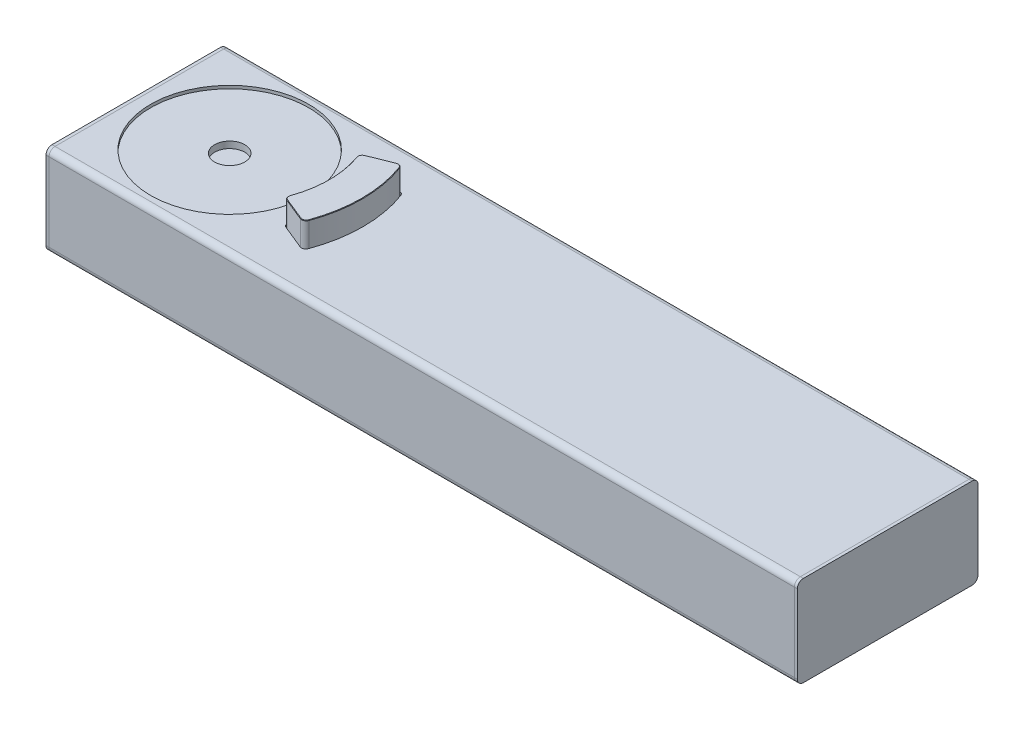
ISO-10303-21;
HEADER;
FILE_DESCRIPTION(('STEP AP214'),'2;1');
FILE_NAME('part.step','',(''),(''),'','','');
FILE_SCHEMA(('AUTOMOTIVE_DESIGN { 1 0 10303 214 1 1 1 1 }'));
ENDSEC;
DATA;
#1=APPLICATION_CONTEXT('core data for automotive mechanical design processes');
#2=APPLICATION_PROTOCOL_DEFINITION('international standard','automotive_design',2000,#1);
#3=PRODUCT_CONTEXT('',#1,'mechanical');
#4=PRODUCT('Part','Part','',(#3));
#5=PRODUCT_RELATED_PRODUCT_CATEGORY('part','',(#4));
#6=PRODUCT_DEFINITION_FORMATION('','',#4);
#7=PRODUCT_DEFINITION_CONTEXT('part definition',#1,'design');
#8=PRODUCT_DEFINITION('design','',#6,#7);
#9=PRODUCT_DEFINITION_SHAPE('','',#8);
#10=(LENGTH_UNIT() NAMED_UNIT(*) SI_UNIT(.MILLI.,.METRE.));
#11=(NAMED_UNIT(*) PLANE_ANGLE_UNIT() SI_UNIT($,.RADIAN.));
#12=(NAMED_UNIT(*) SI_UNIT($,.STERADIAN.) SOLID_ANGLE_UNIT());
#13=UNCERTAINTY_MEASURE_WITH_UNIT(LENGTH_MEASURE(1.E-05),#10,'distance_accuracy_value','');
#14=(GEOMETRIC_REPRESENTATION_CONTEXT(3) GLOBAL_UNCERTAINTY_ASSIGNED_CONTEXT((#13)) GLOBAL_UNIT_ASSIGNED_CONTEXT((#10,
#11,#12)) REPRESENTATION_CONTEXT('',''));
#15=CARTESIAN_POINT('',(0.,0.,0.));
#16=DIRECTION('',(0.,0.,1.));
#17=DIRECTION('',(1.,0.,0.));
#18=AXIS2_PLACEMENT_3D('',#15,#16,#17);
#19=CARTESIAN_POINT('',(492.,26.,-56.));
#20=DIRECTION('',(1.,0.,0.));
#21=DIRECTION('',(0.,0.,-1.));
#22=AXIS2_PLACEMENT_3D('',#19,#20,#21);
#23=PLANE('',#22);
#24=CARTESIAN_POINT('',(492.,-26.,-56.));
#25=DIRECTION('',(1.,0.,0.));
#26=DIRECTION('',(0.,0.,-1.));
#27=AXIS2_PLACEMENT_3D('',#24,#25,#26);
#28=CIRCLE('',#27,4.);
#29=CARTESIAN_POINT('',(492.,-26.,-60.));
#30=VERTEX_POINT('',#29);
#31=CARTESIAN_POINT('',(492.,-30.,-56.));
#32=VERTEX_POINT('',#31);
#33=EDGE_CURVE('P0_E125',#30,#32,#28,.F.);
#34=ORIENTED_EDGE('',*,*,#33,.F.);
#35=DIRECTION('',(0.,1.,0.));
#36=VECTOR('',#35,1.);
#37=CARTESIAN_POINT('',(492.,-26.,-60.));
#38=LINE('',#37,#36);
#39=CARTESIAN_POINT('',(492.,26.,-60.));
#40=VERTEX_POINT('',#39);
#41=EDGE_CURVE('P0_E119',#30,#40,#38,.T.);
#42=ORIENTED_EDGE('',*,*,#41,.T.);
#43=CARTESIAN_POINT('',(492.,26.,-56.));
#44=DIRECTION('',(1.,0.,0.));
#45=DIRECTION('',(0.,0.,-1.));
#46=AXIS2_PLACEMENT_3D('',#43,#44,#45);
#47=CIRCLE('',#46,4.);
#48=CARTESIAN_POINT('',(492.,30.,-56.));
#49=VERTEX_POINT('',#48);
#50=EDGE_CURVE('P0_E106',#49,#40,#47,.F.);
#51=ORIENTED_EDGE('',*,*,#50,.F.);
#52=DIRECTION('',(0.,0.,-1.));
#53=VECTOR('',#52,1.);
#54=CARTESIAN_POINT('',(492.,30.,-56.));
#55=LINE('',#54,#53);
#56=CARTESIAN_POINT('',(492.,30.,56.));
#57=VERTEX_POINT('',#56);
#58=EDGE_CURVE('P0_E103',#49,#57,#55,.F.);
#59=ORIENTED_EDGE('',*,*,#58,.T.);
#60=CARTESIAN_POINT('',(492.,26.,56.));
#61=DIRECTION('',(1.,0.,0.));
#62=DIRECTION('',(0.,0.,-1.));
#63=AXIS2_PLACEMENT_3D('',#60,#61,#62);
#64=CIRCLE('',#63,4.);
#65=CARTESIAN_POINT('',(492.,26.,60.));
#66=VERTEX_POINT('',#65);
#67=EDGE_CURVE('P0_E35',#66,#57,#64,.F.);
#68=ORIENTED_EDGE('',*,*,#67,.F.);
#69=DIRECTION('',(0.,1.,0.));
#70=VECTOR('',#69,1.);
#71=CARTESIAN_POINT('',(492.,-26.,60.));
#72=LINE('',#71,#70);
#73=CARTESIAN_POINT('',(492.,-26.,60.));
#74=VERTEX_POINT('',#73);
#75=EDGE_CURVE('P0_E115',#66,#74,#72,.F.);
#76=ORIENTED_EDGE('',*,*,#75,.T.);
#77=CARTESIAN_POINT('',(492.,-26.,56.));
#78=DIRECTION('',(1.,0.,0.));
#79=DIRECTION('',(0.,0.,-1.));
#80=AXIS2_PLACEMENT_3D('',#77,#78,#79);
#81=CIRCLE('',#80,4.);
#82=CARTESIAN_POINT('',(492.,-30.,56.));
#83=VERTEX_POINT('',#82);
#84=EDGE_CURVE('P0_E127',#83,#74,#81,.F.);
#85=ORIENTED_EDGE('',*,*,#84,.F.);
#86=DIRECTION('',(0.,0.,1.));
#87=VECTOR('',#86,1.);
#88=CARTESIAN_POINT('',(492.,-30.,-56.));
#89=LINE('',#88,#87);
#90=EDGE_CURVE('P0_E122',#83,#32,#89,.F.);
#91=ORIENTED_EDGE('',*,*,#90,.T.);
#92=EDGE_LOOP('',(#34,#42,#51,#59,#68,#76,#85,#91));
#93=FACE_BOUND('',#92,.T.);
#94=ADVANCED_FACE('P0_F32',(#93),#23,.T.);
#95=CARTESIAN_POINT('',(490.,30.,-56.));
#96=DIRECTION('',(0.,-1.,0.));
#97=DIRECTION('',(0.,0.,-1.));
#98=AXIS2_PLACEMENT_3D('',#95,#96,#97);
#99=PLANE('',#98);
#100=DIRECTION('',(1.,0.,0.));
#101=VECTOR('',#100,1.);
#102=CARTESIAN_POINT('',(490.,30.,-56.));
#103=LINE('',#102,#101);
#104=CARTESIAN_POINT('',(490.,30.,-56.));
#105=VERTEX_POINT('',#104);
#106=EDGE_CURVE('P0_E151',#105,#49,#103,.T.);
#107=ORIENTED_EDGE('',*,*,#106,.F.);
#108=DIRECTION('',(0.,0.,-1.));
#109=VECTOR('',#108,1.);
#110=CARTESIAN_POINT('',(490.,30.,-56.));
#111=LINE('',#110,#109);
#112=CARTESIAN_POINT('',(490.,30.,56.));
#113=VERTEX_POINT('',#112);
#114=EDGE_CURVE('P0_E113',#105,#113,#111,.F.);
#115=ORIENTED_EDGE('',*,*,#114,.T.);
#116=DIRECTION('',(1.,0.,0.));
#117=VECTOR('',#116,1.);
#118=CARTESIAN_POINT('',(490.,30.,56.));
#119=LINE('',#118,#117);
#120=EDGE_CURVE('P0_E100',#57,#113,#119,.F.);
#121=ORIENTED_EDGE('',*,*,#120,.F.);
#122=ORIENTED_EDGE('',*,*,#58,.F.);
#123=EDGE_LOOP('',(#107,#115,#121,#122));
#124=FACE_BOUND('',#123,.T.);
#125=ADVANCED_FACE('P0_F112',(#124),#99,.F.);
#126=CARTESIAN_POINT('',(490.,26.,56.));
#127=DIRECTION('',(1.,0.,0.));
#128=DIRECTION('',(0.,0.,-1.));
#129=AXIS2_PLACEMENT_3D('',#126,#127,#128);
#130=CYLINDRICAL_SURFACE('',#129,4.);
#131=CARTESIAN_POINT('',(490.,26.,56.));
#132=DIRECTION('',(1.,0.,0.));
#133=DIRECTION('',(0.,0.,-1.));
#134=AXIS2_PLACEMENT_3D('',#131,#132,#133);
#135=CIRCLE('',#134,4.);
#136=CARTESIAN_POINT('',(490.,26.,60.));
#137=VERTEX_POINT('',#136);
#138=EDGE_CURVE('P0_E137',#113,#137,#135,.T.);
#139=ORIENTED_EDGE('',*,*,#138,.T.);
#140=DIRECTION('',(-1.,0.,0.));
#141=VECTOR('',#140,1.);
#142=CARTESIAN_POINT('',(490.,26.,60.));
#143=LINE('',#142,#141);
#144=EDGE_CURVE('P0_E102',#137,#66,#143,.F.);
#145=ORIENTED_EDGE('',*,*,#144,.T.);
#146=ORIENTED_EDGE('',*,*,#67,.T.);
#147=ORIENTED_EDGE('',*,*,#120,.T.);
#148=EDGE_LOOP('',(#139,#145,#146,#147));
#149=FACE_BOUND('',#148,.T.);
#150=ADVANCED_FACE('P0_F98',(#149),#130,.T.);
#151=CARTESIAN_POINT('',(490.,-26.,60.));
#152=DIRECTION('',(0.,0.,-1.));
#153=DIRECTION('',(-1.,0.,0.));
#154=AXIS2_PLACEMENT_3D('',#151,#152,#153);
#155=PLANE('',#154);
#156=ORIENTED_EDGE('',*,*,#144,.F.);
#157=DIRECTION('',(0.,1.,0.));
#158=VECTOR('',#157,1.);
#159=CARTESIAN_POINT('',(490.,26.,60.));
#160=LINE('',#159,#158);
#161=CARTESIAN_POINT('',(490.,-26.,60.));
#162=VERTEX_POINT('',#161);
#163=EDGE_CURVE('P0_E136',#137,#162,#160,.F.);
#164=ORIENTED_EDGE('',*,*,#163,.T.);
#165=DIRECTION('',(1.,0.,0.));
#166=VECTOR('',#165,1.);
#167=CARTESIAN_POINT('',(490.,-26.,60.));
#168=LINE('',#167,#166);
#169=EDGE_CURVE('P0_E141',#74,#162,#168,.F.);
#170=ORIENTED_EDGE('',*,*,#169,.F.);
#171=ORIENTED_EDGE('',*,*,#75,.F.);
#172=EDGE_LOOP('',(#156,#164,#170,#171));
#173=FACE_BOUND('',#172,.T.);
#174=ADVANCED_FACE('P0_F177',(#173),#155,.F.);
#175=CARTESIAN_POINT('',(490.,-26.,56.));
#176=DIRECTION('',(1.,0.,0.));
#177=DIRECTION('',(0.,0.,-1.));
#178=AXIS2_PLACEMENT_3D('',#175,#176,#177);
#179=CYLINDRICAL_SURFACE('',#178,4.);
#180=CARTESIAN_POINT('',(490.,-26.,56.));
#181=DIRECTION('',(1.,0.,0.));
#182=DIRECTION('',(0.,0.,-1.));
#183=AXIS2_PLACEMENT_3D('',#180,#181,#182);
#184=CIRCLE('',#183,4.);
#185=CARTESIAN_POINT('',(490.,-30.,56.));
#186=VERTEX_POINT('',#185);
#187=EDGE_CURVE('P0_E133',#162,#186,#184,.T.);
#188=ORIENTED_EDGE('',*,*,#187,.T.);
#189=DIRECTION('',(1.,0.,0.));
#190=VECTOR('',#189,1.);
#191=CARTESIAN_POINT('',(490.,-30.,56.));
#192=LINE('',#191,#190);
#193=EDGE_CURVE('P0_E126',#186,#83,#192,.T.);
#194=ORIENTED_EDGE('',*,*,#193,.T.);
#195=ORIENTED_EDGE('',*,*,#84,.T.);
#196=ORIENTED_EDGE('',*,*,#169,.T.);
#197=EDGE_LOOP('',(#188,#194,#195,#196));
#198=FACE_BOUND('',#197,.T.);
#199=ADVANCED_FACE('P0_F175',(#198),#179,.T.);
#200=CARTESIAN_POINT('',(490.,-30.,-56.));
#201=DIRECTION('',(0.,1.,0.));
#202=DIRECTION('',(0.,0.,1.));
#203=AXIS2_PLACEMENT_3D('',#200,#201,#202);
#204=PLANE('',#203);
#205=ORIENTED_EDGE('',*,*,#193,.F.);
#206=DIRECTION('',(0.,0.,-1.));
#207=VECTOR('',#206,1.);
#208=CARTESIAN_POINT('',(490.,-30.,-56.));
#209=LINE('',#208,#207);
#210=CARTESIAN_POINT('',(490.,-30.,-56.));
#211=VERTEX_POINT('',#210);
#212=EDGE_CURVE('P0_E132',#186,#211,#209,.T.);
#213=ORIENTED_EDGE('',*,*,#212,.T.);
#214=DIRECTION('',(1.,0.,0.));
#215=VECTOR('',#214,1.);
#216=CARTESIAN_POINT('',(490.,-30.,-56.));
#217=LINE('',#216,#215);
#218=EDGE_CURVE('P0_E140',#32,#211,#217,.F.);
#219=ORIENTED_EDGE('',*,*,#218,.F.);
#220=ORIENTED_EDGE('',*,*,#90,.F.);
#221=EDGE_LOOP('',(#205,#213,#219,#220));
#222=FACE_BOUND('',#221,.T.);
#223=ADVANCED_FACE('P0_F173',(#222),#204,.F.);
#224=CARTESIAN_POINT('',(490.,-26.,-56.));
#225=DIRECTION('',(1.,0.,0.));
#226=DIRECTION('',(0.,0.,-1.));
#227=AXIS2_PLACEMENT_3D('',#224,#225,#226);
#228=CYLINDRICAL_SURFACE('',#227,4.);
#229=CARTESIAN_POINT('',(490.,-26.,-56.));
#230=DIRECTION('',(1.,0.,0.));
#231=DIRECTION('',(0.,0.,-1.));
#232=AXIS2_PLACEMENT_3D('',#229,#230,#231);
#233=CIRCLE('',#232,4.);
#234=CARTESIAN_POINT('',(490.,-26.,-60.));
#235=VERTEX_POINT('',#234);
#236=EDGE_CURVE('P0_E129',#211,#235,#233,.T.);
#237=ORIENTED_EDGE('',*,*,#236,.T.);
#238=DIRECTION('',(1.,0.,0.));
#239=VECTOR('',#238,1.);
#240=CARTESIAN_POINT('',(490.,-26.,-60.));
#241=LINE('',#240,#239);
#242=EDGE_CURVE('P0_E121',#235,#30,#241,.T.);
#243=ORIENTED_EDGE('',*,*,#242,.T.);
#244=ORIENTED_EDGE('',*,*,#33,.T.);
#245=ORIENTED_EDGE('',*,*,#218,.T.);
#246=EDGE_LOOP('',(#237,#243,#244,#245));
#247=FACE_BOUND('',#246,.T.);
#248=ADVANCED_FACE('P0_F169',(#247),#228,.T.);
#249=CARTESIAN_POINT('',(490.,-26.,-60.));
#250=DIRECTION('',(0.,0.,1.));
#251=DIRECTION('',(1.,0.,0.));
#252=AXIS2_PLACEMENT_3D('',#249,#250,#251);
#253=PLANE('',#252);
#254=ORIENTED_EDGE('',*,*,#242,.F.);
#255=DIRECTION('',(0.,1.,0.));
#256=VECTOR('',#255,1.);
#257=CARTESIAN_POINT('',(490.,26.,-60.));
#258=LINE('',#257,#256);
#259=CARTESIAN_POINT('',(490.,26.,-60.));
#260=VERTEX_POINT('',#259);
#261=EDGE_CURVE('P0_E41',#235,#260,#258,.T.);
#262=ORIENTED_EDGE('',*,*,#261,.T.);
#263=DIRECTION('',(1.,0.,0.));
#264=VECTOR('',#263,1.);
#265=CARTESIAN_POINT('',(490.,26.,-60.));
#266=LINE('',#265,#264);
#267=EDGE_CURVE('P0_E49',#40,#260,#266,.F.);
#268=ORIENTED_EDGE('',*,*,#267,.F.);
#269=ORIENTED_EDGE('',*,*,#41,.F.);
#270=EDGE_LOOP('',(#254,#262,#268,#269));
#271=FACE_BOUND('',#270,.T.);
#272=ADVANCED_FACE('P0_F162',(#271),#253,.F.);
#273=CARTESIAN_POINT('',(490.,26.,-56.));
#274=DIRECTION('',(1.,0.,0.));
#275=DIRECTION('',(0.,0.,-1.));
#276=AXIS2_PLACEMENT_3D('',#273,#274,#275);
#277=CYLINDRICAL_SURFACE('',#276,4.);
#278=CARTESIAN_POINT('',(490.,26.,-56.));
#279=DIRECTION('',(1.,0.,0.));
#280=DIRECTION('',(0.,0.,-1.));
#281=AXIS2_PLACEMENT_3D('',#278,#279,#280);
#282=CIRCLE('',#281,4.);
#283=EDGE_CURVE('P0_E11',#260,#105,#282,.T.);
#284=ORIENTED_EDGE('',*,*,#283,.T.);
#285=ORIENTED_EDGE('',*,*,#106,.T.);
#286=ORIENTED_EDGE('',*,*,#50,.T.);
#287=ORIENTED_EDGE('',*,*,#267,.T.);
#288=EDGE_LOOP('',(#284,#285,#286,#287));
#289=FACE_BOUND('',#288,.T.);
#290=ADVANCED_FACE('P0_F187',(#289),#277,.T.);
#291=CARTESIAN_POINT('',(490.,26.,-56.));
#292=DIRECTION('',(1.,0.,0.));
#293=DIRECTION('',(0.,0.,-1.));
#294=AXIS2_PLACEMENT_3D('',#291,#292,#293);
#295=PLANE('',#294);
#296=ORIENTED_EDGE('',*,*,#261,.F.);
#297=ORIENTED_EDGE('',*,*,#236,.F.);
#298=ORIENTED_EDGE('',*,*,#212,.F.);
#299=ORIENTED_EDGE('',*,*,#187,.F.);
#300=ORIENTED_EDGE('',*,*,#163,.F.);
#301=ORIENTED_EDGE('',*,*,#138,.F.);
#302=ORIENTED_EDGE('',*,*,#114,.F.);
#303=ORIENTED_EDGE('',*,*,#283,.F.);
#304=EDGE_LOOP('',(#296,#297,#298,#299,#300,#301,#302,#303));
#305=FACE_BOUND('',#304,.T.);
#306=ADVANCED_FACE('P0_F166',(#305),#295,.F.);
#307=CLOSED_SHELL('',(#94,#125,#150,#174,#199,#223,#248,#272,#290,#306));
#308=MANIFOLD_SOLID_BREP('P0_B2',#307);
#309=CARTESIAN_POINT('',(55.,28.,0.));
#310=DIRECTION('',(0.,1.,0.));
#311=DIRECTION('',(0.,0.,1.));
#312=AXIS2_PLACEMENT_3D('',#309,#310,#311);
#313=PLANE('',#312);
#314=CARTESIAN_POINT('',(134.88534591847,28.00000000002,29.0401705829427));
#315=DIRECTION('',(0.,1.,0.));
#316=DIRECTION('',(0.,0.,1.));
#317=AXIS2_PLACEMENT_3D('',#314,#315,#316);
#318=CIRCLE('',#317,2.70000000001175);
#319=CARTESIAN_POINT('',(133.87390811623,28.0000000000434,31.5435669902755));
#320=VERTEX_POINT('',#319);
#321=CARTESIAN_POINT('',(137.422880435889,28.00000000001,29.9626230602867));
#322=VERTEX_POINT('',#321);
#323=EDGE_CURVE('P1_E20',#320,#322,#318,.T.);
#324=ORIENTED_EDGE('',*,*,#323,.F.);
#325=DIRECTION('',(-0.927183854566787,0.,-0.374606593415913));
#326=VECTOR('',#325,1.);
#327=CARTESIAN_POINT('',(133.873908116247,28.,31.543566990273));
#328=LINE('',#327,#326);
#329=CARTESIAN_POINT('',(119.027570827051,27.9999999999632,25.5452573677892));
#330=VERTEX_POINT('',#329);
#331=EDGE_CURVE('P1_E81',#320,#330,#328,.T.);
#332=ORIENTED_EDGE('',*,*,#331,.T.);
#333=CARTESIAN_POINT('',(120.039008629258,28.00000000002,23.0418609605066));
#334=DIRECTION('',(0.,1.,0.));
#335=DIRECTION('',(0.,0.,1.));
#336=AXIS2_PLACEMENT_3D('',#333,#334,#335);
#337=CIRCLE('',#336,2.70000000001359);
#338=CARTESIAN_POINT('',(117.494003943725,28.0000000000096,22.1402229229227));
#339=VERTEX_POINT('',#338);
#340=EDGE_CURVE('P1_E136',#339,#330,#337,.T.);
#341=ORIENTED_EDGE('',*,*,#340,.F.);
#342=CARTESIAN_POINT('',(55.,28.,0.));
#343=DIRECTION('',(0.,-1.,0.));
#344=DIRECTION('',(0.,0.,-1.));
#345=AXIS2_PLACEMENT_3D('',#342,#343,#344);
#346=CIRCLE('',#345,66.3);
#347=CARTESIAN_POINT('',(117.494003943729,28.0000000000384,-22.1402229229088));
#348=VERTEX_POINT('',#347);
#349=EDGE_CURVE('P1_E141',#339,#348,#346,.F.);
#350=ORIENTED_EDGE('',*,*,#349,.T.);
#351=CARTESIAN_POINT('',(120.039008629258,28.0000000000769,-23.0418609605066));
#352=DIRECTION('',(0.,1.,0.));
#353=DIRECTION('',(0.,0.,1.));
#354=AXIS2_PLACEMENT_3D('',#351,#352,#353);
#355=CIRCLE('',#354,2.70000000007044);
#356=CARTESIAN_POINT('',(119.027570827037,28.0000000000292,-25.545257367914));
#357=VERTEX_POINT('',#356);
#358=EDGE_CURVE('P1_E144',#357,#348,#355,.T.);
#359=ORIENTED_EDGE('',*,*,#358,.F.);
#360=DIRECTION('',(0.927183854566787,0.,-0.374606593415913));
#361=VECTOR('',#360,1.);
#362=CARTESIAN_POINT('',(119.027570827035,28.,-25.5452573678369));
#363=LINE('',#362,#361);
#364=CARTESIAN_POINT('',(133.873908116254,27.9999999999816,-31.5435669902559));
#365=VERTEX_POINT('',#364);
#366=EDGE_CURVE('P1_E118',#357,#365,#363,.T.);
#367=ORIENTED_EDGE('',*,*,#366,.T.);
#368=CARTESIAN_POINT('',(134.88534591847,27.9999999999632,-29.0401705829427));
#369=DIRECTION('',(0.,1.,0.));
#370=DIRECTION('',(0.,0.,1.));
#371=AXIS2_PLACEMENT_3D('',#368,#369,#370);
#372=CIRCLE('',#371,2.69999999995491);
#373=CARTESIAN_POINT('',(137.422880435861,27.9999999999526,-29.9626230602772));
#374=VERTEX_POINT('',#373);
#375=EDGE_CURVE('P1_E99',#374,#365,#372,.T.);
#376=ORIENTED_EDGE('',*,*,#375,.F.);
#377=CARTESIAN_POINT('',(55.,28.,0.));
#378=DIRECTION('',(0.,1.,0.));
#379=DIRECTION('',(0.,0.,1.));
#380=AXIS2_PLACEMENT_3D('',#377,#378,#379);
#381=CIRCLE('',#380,87.7);
#382=EDGE_CURVE('P1_E97',#322,#374,#381,.T.);
#383=ORIENTED_EDGE('',*,*,#382,.F.);
#384=EDGE_LOOP('',(#324,#332,#341,#350,#359,#367,#376,#383));
#385=FACE_BOUND('',#384,.T.);
#386=ADVANCED_FACE('P1_F17',(#385),#313,.F.);
#387=CARTESIAN_POINT('',(116.194134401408,28.3,24.7240351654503));
#388=DIRECTION('',(0.26488686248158,0.70710678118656,-0.655617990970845));
#389=DIRECTION('',(0.,0.67990452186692,0.733300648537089));
#390=AXIS2_PLACEMENT_3D('',#387,#388,#389);
#391=PLANE('',#390);
#392=ORIENTED_EDGE('',*,*,#331,.F.);
#393=DIRECTION('',(0.264886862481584,-0.707106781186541,-0.655617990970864));
#394=VECTOR('',#393,1.);
#395=CARTESIAN_POINT('',(-186784.32722181,499000.,462670.325847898));
#396=LINE('',#395,#394);
#397=CARTESIAN_POINT('',(133.761526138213,28.3000000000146,31.8217221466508));
#398=VERTEX_POINT('',#397);
#399=EDGE_CURVE('P1_E94',#398,#320,#396,.T.);
#400=ORIENTED_EDGE('',*,*,#399,.F.);
#401=DIRECTION('',(-0.927183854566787,0.,-0.374606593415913));
#402=VECTOR('',#401,1.);
#403=CARTESIAN_POINT('',(116.194134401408,28.3,24.7240351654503));
#404=LINE('',#403,#402);
#405=CARTESIAN_POINT('',(118.915188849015,28.3000000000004,25.8234125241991));
#406=VERTEX_POINT('',#405);
#407=EDGE_CURVE('P1_E181',#398,#406,#404,.T.);
#408=ORIENTED_EDGE('',*,*,#407,.T.);
#409=DIRECTION('',(0.264886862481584,-0.707106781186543,-0.655617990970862));
#410=VECTOR('',#409,1.);
#411=CARTESIAN_POINT('',(-186799.173559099,499000.,462664.327538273));
#412=LINE('',#411,#410);
#413=EDGE_CURVE('P1_E139',#330,#406,#412,.F.);
#414=ORIENTED_EDGE('',*,*,#413,.F.);
#415=EDGE_LOOP('',(#392,#400,#408,#414));
#416=FACE_BOUND('',#415,.T.);
#417=ADVANCED_FACE('P1_F310',(#416),#391,.F.);
#418=CARTESIAN_POINT('',(134.88534591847,28.3000000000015,29.0401705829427));
#419=DIRECTION('',(0.,1.,0.));
#420=DIRECTION('',(0.,0.,1.));
#421=AXIS2_PLACEMENT_3D('',#418,#419,#420);
#422=CONICAL_SURFACE('',#421,2.99999999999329,0.785398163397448);
#423=ORIENTED_EDGE('',*,*,#399,.T.);
#424=ORIENTED_EDGE('',*,*,#323,.T.);
#425=DIRECTION('',(-0.664558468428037,-0.707106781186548,-0.241582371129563));
#426=VECTOR('',#425,1.);
#427=CARTESIAN_POINT('',(137.704828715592,28.3,30.0651177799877));
#428=LINE('',#427,#426);
#429=CARTESIAN_POINT('',(137.704828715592,28.3,30.0651177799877));
#430=VERTEX_POINT('',#429);
#431=EDGE_CURVE('P1_E92',#430,#322,#428,.T.);
#432=ORIENTED_EDGE('',*,*,#431,.F.);
#433=CARTESIAN_POINT('',(134.88534591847,28.3,29.0401705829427));
#434=DIRECTION('',(0.,-1.,0.));
#435=DIRECTION('',(0.,0.,-1.));
#436=AXIS2_PLACEMENT_3D('',#433,#434,#435);
#437=CIRCLE('',#436,3.);
#438=EDGE_CURVE('P1_E112',#398,#430,#437,.F.);
#439=ORIENTED_EDGE('',*,*,#438,.F.);
#440=EDGE_LOOP('',(#423,#424,#432,#439));
#441=FACE_BOUND('',#440,.T.);
#442=ADVANCED_FACE('P1_F88',(#441),#422,.T.);
#443=CARTESIAN_POINT('',(55.,28.3,0.));
#444=DIRECTION('',(0.,1.,0.));
#445=DIRECTION('',(0.,0.,1.));
#446=AXIS2_PLACEMENT_3D('',#443,#444,#445);
#447=CONICAL_SURFACE('',#446,88.,0.785398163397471);
#448=ORIENTED_EDGE('',*,*,#431,.T.);
#449=ORIENTED_EDGE('',*,*,#382,.T.);
#450=DIRECTION('',(-0.664558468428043,-0.70710678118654,0.241582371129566));
#451=VECTOR('',#450,1.);
#452=CARTESIAN_POINT('',(469085.079629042,499000.,-170503.280224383));
#453=LINE('',#452,#451);
#454=CARTESIAN_POINT('',(137.704828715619,28.3000000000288,-30.0651177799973));
#455=VERTEX_POINT('',#454);
#456=EDGE_CURVE('P1_E103',#455,#374,#453,.T.);
#457=ORIENTED_EDGE('',*,*,#456,.F.);
#458=CARTESIAN_POINT('',(55.,28.3,0.));
#459=DIRECTION('',(0.,-1.,0.));
#460=DIRECTION('',(0.,0.,-1.));
#461=AXIS2_PLACEMENT_3D('',#458,#459,#460);
#462=CIRCLE('',#461,88.);
#463=EDGE_CURVE('P1_E107',#430,#455,#462,.F.);
#464=ORIENTED_EDGE('',*,*,#463,.F.);
#465=EDGE_LOOP('',(#448,#449,#457,#464));
#466=FACE_BOUND('',#465,.T.);
#467=ADVANCED_FACE('P1_F105',(#466),#447,.T.);
#468=CARTESIAN_POINT('',(134.88534591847,28.3000000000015,-29.0401705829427));
#469=DIRECTION('',(0.,1.,0.));
#470=DIRECTION('',(0.,0.,1.));
#471=AXIS2_PLACEMENT_3D('',#468,#469,#470);
#472=CONICAL_SURFACE('',#471,3.00000000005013,0.785398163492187);
#473=ORIENTED_EDGE('',*,*,#456,.T.);
#474=ORIENTED_EDGE('',*,*,#375,.T.);
#475=DIRECTION('',(-0.264886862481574,0.707106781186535,-0.655617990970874));
#476=VECTOR('',#475,1.);
#477=CARTESIAN_POINT('',(133.873908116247,28.,-31.543566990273));
#478=LINE('',#477,#476);
#479=CARTESIAN_POINT('',(133.761526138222,28.3,-31.8217221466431));
#480=VERTEX_POINT('',#479);
#481=EDGE_CURVE('P1_E119',#365,#480,#478,.T.);
#482=ORIENTED_EDGE('',*,*,#481,.T.);
#483=CARTESIAN_POINT('',(134.88534591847,28.3,-29.0401705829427));
#484=DIRECTION('',(0.,-1.,0.));
#485=DIRECTION('',(0.,0.,-1.));
#486=AXIS2_PLACEMENT_3D('',#483,#484,#485);
#487=CIRCLE('',#486,3.);
#488=EDGE_CURVE('P1_E154',#455,#480,#487,.F.);
#489=ORIENTED_EDGE('',*,*,#488,.F.);
#490=EDGE_LOOP('',(#473,#474,#482,#489));
#491=FACE_BOUND('',#490,.T.);
#492=ADVANCED_FACE('P1_F352',(#491),#472,.T.);
#493=CARTESIAN_POINT('',(116.194134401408,28.3,-24.7240351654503));
#494=DIRECTION('',(0.26488686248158,0.70710678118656,0.655617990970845));
#495=DIRECTION('',(0.,-0.67990452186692,0.733300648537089));
#496=AXIS2_PLACEMENT_3D('',#493,#494,#495);
#497=PLANE('',#496);
#498=DIRECTION('',(0.927183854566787,0.,-0.374606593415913));
#499=VECTOR('',#498,1.);
#500=CARTESIAN_POINT('',(116.194134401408,28.3,-24.7240351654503));
#501=LINE('',#500,#499);
#502=CARTESIAN_POINT('',(118.915188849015,28.299999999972,-25.8234125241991));
#503=VERTEX_POINT('',#502);
#504=EDGE_CURVE('P1_E157',#503,#480,#501,.T.);
#505=ORIENTED_EDGE('',*,*,#504,.T.);
#506=ORIENTED_EDGE('',*,*,#481,.F.);
#507=ORIENTED_EDGE('',*,*,#366,.F.);
#508=DIRECTION('',(0.264886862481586,-0.707106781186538,0.655617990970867));
#509=VECTOR('',#508,1.);
#510=CARTESIAN_POINT('',(-186799.173559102,499000.,-462664.32753828));
#511=LINE('',#510,#509);
#512=EDGE_CURVE('P1_E147',#503,#357,#511,.T.);
#513=ORIENTED_EDGE('',*,*,#512,.F.);
#514=EDGE_LOOP('',(#505,#506,#507,#513));
#515=FACE_BOUND('',#514,.T.);
#516=ADVANCED_FACE('P1_F351',(#515),#497,.F.);
#517=CARTESIAN_POINT('',(120.039008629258,28.2999999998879,-23.0418609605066));
#518=DIRECTION('',(0.,1.,0.));
#519=DIRECTION('',(0.,0.,1.));
#520=AXIS2_PLACEMENT_3D('',#517,#518,#519);
#521=CONICAL_SURFACE('',#520,2.99999999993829,0.785398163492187);
#522=DIRECTION('',(-0.666514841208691,0.707106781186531,0.23613124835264));
#523=VECTOR('',#522,1.);
#524=CARTESIAN_POINT('',(117.211225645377,28.3,-22.0400409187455));
#525=LINE('',#524,#523);
#526=CARTESIAN_POINT('',(117.211225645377,28.3,-22.0400409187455));
#527=VERTEX_POINT('',#526);
#528=EDGE_CURVE('P1_E143',#348,#527,#525,.T.);
#529=ORIENTED_EDGE('',*,*,#528,.T.);
#530=CARTESIAN_POINT('',(120.039008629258,28.3,-23.0418609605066));
#531=DIRECTION('',(0.,-1.,0.));
#532=DIRECTION('',(0.,0.,-1.));
#533=AXIS2_PLACEMENT_3D('',#530,#531,#532);
#534=CIRCLE('',#533,3.);
#535=EDGE_CURVE('P1_E166',#503,#527,#534,.F.);
#536=ORIENTED_EDGE('',*,*,#535,.F.);
#537=ORIENTED_EDGE('',*,*,#512,.T.);
#538=ORIENTED_EDGE('',*,*,#358,.T.);
#539=EDGE_LOOP('',(#529,#536,#537,#538));
#540=FACE_BOUND('',#539,.T.);
#541=ADVANCED_FACE('P1_F348',(#540),#521,.T.);
#542=CARTESIAN_POINT('',(55.,28.,0.));
#543=DIRECTION('',(0.,-1.,0.));
#544=DIRECTION('',(0.,0.,-1.));
#545=AXIS2_PLACEMENT_3D('',#542,#543,#544);
#546=CONICAL_SURFACE('',#545,66.3,0.785398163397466);
#547=CARTESIAN_POINT('',(55.,28.3,0.));
#548=DIRECTION('',(0.,-1.,0.));
#549=DIRECTION('',(0.,0.,-1.));
#550=AXIS2_PLACEMENT_3D('',#547,#548,#549);
#551=CIRCLE('',#550,66.);
#552=CARTESIAN_POINT('',(117.21122564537,28.3000000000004,22.0400409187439));
#553=VERTEX_POINT('',#552);
#554=EDGE_CURVE('P1_E169',#553,#527,#551,.F.);
#555=ORIENTED_EDGE('',*,*,#554,.T.);
#556=ORIENTED_EDGE('',*,*,#528,.F.);
#557=ORIENTED_EDGE('',*,*,#349,.F.);
#558=DIRECTION('',(0.66651484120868,-0.707106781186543,0.236131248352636));
#559=VECTOR('',#558,1.);
#560=CARTESIAN_POINT('',(-470210.683007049,499000.,-166604.576402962));
#561=LINE('',#560,#559);
#562=EDGE_CURVE('P1_E140',#553,#339,#561,.T.);
#563=ORIENTED_EDGE('',*,*,#562,.F.);
#564=EDGE_LOOP('',(#555,#556,#557,#563));
#565=FACE_BOUND('',#564,.T.);
#566=ADVANCED_FACE('P1_F343',(#565),#546,.F.);
#567=CARTESIAN_POINT('',(120.039008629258,28.2999999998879,23.0418609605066));
#568=DIRECTION('',(0.,1.,0.));
#569=DIRECTION('',(0.,0.,1.));
#570=AXIS2_PLACEMENT_3D('',#567,#568,#569);
#571=CONICAL_SURFACE('',#570,2.99999999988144,0.785398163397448);
#572=ORIENTED_EDGE('',*,*,#413,.T.);
#573=CARTESIAN_POINT('',(120.039008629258,28.3,23.0418609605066));
#574=DIRECTION('',(0.,-1.,0.));
#575=DIRECTION('',(0.,0.,-1.));
#576=AXIS2_PLACEMENT_3D('',#573,#574,#575);
#577=CIRCLE('',#576,3.);
#578=EDGE_CURVE('P1_E174',#553,#406,#577,.F.);
#579=ORIENTED_EDGE('',*,*,#578,.F.);
#580=ORIENTED_EDGE('',*,*,#562,.T.);
#581=ORIENTED_EDGE('',*,*,#340,.T.);
#582=EDGE_LOOP('',(#572,#579,#580,#581));
#583=FACE_BOUND('',#582,.T.);
#584=ADVANCED_FACE('P1_F341',(#583),#571,.T.);
#585=CARTESIAN_POINT('',(116.194134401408,46.,24.7240351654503));
#586=DIRECTION('',(0.374606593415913,0.,-0.927183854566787));
#587=DIRECTION('',(-0.927183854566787,0.,-0.374606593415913));
#588=AXIS2_PLACEMENT_3D('',#585,#586,#587);
#589=PLANE('',#588);
#590=DIRECTION('',(0.927183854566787,0.,0.374606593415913));
#591=VECTOR('',#590,1.);
#592=CARTESIAN_POINT('',(118.91518884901,45.7,25.823412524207));
#593=LINE('',#592,#591);
#594=CARTESIAN_POINT('',(118.915188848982,45.7000000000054,25.8234125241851));
#595=VERTEX_POINT('',#594);
#596=CARTESIAN_POINT('',(133.761526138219,45.7000000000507,31.8217221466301));
#597=VERTEX_POINT('',#596);
#598=EDGE_CURVE('P1_E177',#595,#597,#593,.T.);
#599=ORIENTED_EDGE('',*,*,#598,.F.);
#600=DIRECTION('',(0.,-1.,0.));
#601=VECTOR('',#600,1.);
#602=CARTESIAN_POINT('',(118.91518884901,46.,25.823412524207));
#603=LINE('',#602,#601);
#604=EDGE_CURVE('P1_E215',#406,#595,#603,.F.);
#605=ORIENTED_EDGE('',*,*,#604,.F.);
#606=ORIENTED_EDGE('',*,*,#407,.F.);
#607=DIRECTION('',(0.,-1.,0.));
#608=VECTOR('',#607,1.);
#609=CARTESIAN_POINT('',(133.761526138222,46.,31.8217221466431));
#610=LINE('',#609,#608);
#611=EDGE_CURVE('P1_E115',#597,#398,#610,.T.);
#612=ORIENTED_EDGE('',*,*,#611,.F.);
#613=EDGE_LOOP('',(#599,#605,#606,#612));
#614=FACE_BOUND('',#613,.T.);
#615=ADVANCED_FACE('P1_F311',(#614),#589,.F.);
#616=CARTESIAN_POINT('',(134.88534591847,46.,29.0401705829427));
#617=DIRECTION('',(0.,-1.,0.));
#618=DIRECTION('',(0.,0.,-1.));
#619=AXIS2_PLACEMENT_3D('',#616,#617,#618);
#620=CYLINDRICAL_SURFACE('',#619,3.);
#621=ORIENTED_EDGE('',*,*,#611,.T.);
#622=ORIENTED_EDGE('',*,*,#438,.T.);
#623=DIRECTION('',(0.,-1.,0.));
#624=VECTOR('',#623,1.);
#625=CARTESIAN_POINT('',(137.704828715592,46.,30.0651177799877));
#626=LINE('',#625,#624);
#627=CARTESIAN_POINT('',(137.704828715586,45.7000000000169,30.0651177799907));
#628=VERTEX_POINT('',#627);
#629=EDGE_CURVE('P1_E114',#628,#430,#626,.T.);
#630=ORIENTED_EDGE('',*,*,#629,.F.);
#631=CARTESIAN_POINT('',(134.88534591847,45.7000000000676,29.0401705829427));
#632=DIRECTION('',(0.,-1.,0.));
#633=DIRECTION('',(1.,0.,0.));
#634=AXIS2_PLACEMENT_3D('',#631,#632,#633);
#635=CIRCLE('',#634,2.99999999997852);
#636=EDGE_CURVE('P1_E188',#597,#628,#635,.F.);
#637=ORIENTED_EDGE('',*,*,#636,.F.);
#638=EDGE_LOOP('',(#621,#622,#630,#637));
#639=FACE_BOUND('',#638,.T.);
#640=ADVANCED_FACE('P1_F314',(#639),#620,.T.);
#641=CARTESIAN_POINT('',(55.,46.,0.));
#642=DIRECTION('',(0.,-1.,0.));
#643=DIRECTION('',(0.,0.,-1.));
#644=AXIS2_PLACEMENT_3D('',#641,#642,#643);
#645=CYLINDRICAL_SURFACE('',#644,88.);
#646=ORIENTED_EDGE('',*,*,#463,.T.);
#647=DIRECTION('',(0.,-1.,0.));
#648=VECTOR('',#647,1.);
#649=CARTESIAN_POINT('',(137.704828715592,46.,-30.0651177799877));
#650=LINE('',#649,#648);
#651=CARTESIAN_POINT('',(137.704828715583,45.7000000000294,-30.065117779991));
#652=VERTEX_POINT('',#651);
#653=EDGE_CURVE('P1_E158',#652,#455,#650,.T.);
#654=ORIENTED_EDGE('',*,*,#653,.F.);
#655=CARTESIAN_POINT('',(55.,45.7,0.));
#656=DIRECTION('',(0.,-1.,0.));
#657=DIRECTION('',(1.,0.,0.));
#658=AXIS2_PLACEMENT_3D('',#655,#656,#657);
#659=CIRCLE('',#658,88.);
#660=EDGE_CURVE('P1_E195',#628,#652,#659,.F.);
#661=ORIENTED_EDGE('',*,*,#660,.F.);
#662=ORIENTED_EDGE('',*,*,#629,.T.);
#663=EDGE_LOOP('',(#646,#654,#661,#662));
#664=FACE_BOUND('',#663,.T.);
#665=ADVANCED_FACE('P1_F355',(#664),#645,.T.);
#666=CARTESIAN_POINT('',(134.88534591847,46.,-29.0401705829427));
#667=DIRECTION('',(0.,-1.,0.));
#668=DIRECTION('',(0.,0.,-1.));
#669=AXIS2_PLACEMENT_3D('',#666,#667,#668);
#670=CYLINDRICAL_SURFACE('',#669,3.);
#671=ORIENTED_EDGE('',*,*,#653,.T.);
#672=ORIENTED_EDGE('',*,*,#488,.T.);
#673=DIRECTION('',(0.,1.,0.));
#674=VECTOR('',#673,1.);
#675=CARTESIAN_POINT('',(133.761526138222,46.,-31.8217221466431));
#676=LINE('',#675,#674);
#677=CARTESIAN_POINT('',(133.761526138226,45.7000000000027,-31.8217221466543));
#678=VERTEX_POINT('',#677);
#679=EDGE_CURVE('P1_E161',#480,#678,#676,.T.);
#680=ORIENTED_EDGE('',*,*,#679,.T.);
#681=CARTESIAN_POINT('',(134.88534591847,45.7000000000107,-29.0401705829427));
#682=DIRECTION('',(0.,-1.,0.));
#683=DIRECTION('',(1.,0.,0.));
#684=AXIS2_PLACEMENT_3D('',#681,#682,#683);
#685=CIRCLE('',#684,3.00000000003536);
#686=EDGE_CURVE('P1_E201',#652,#678,#685,.F.);
#687=ORIENTED_EDGE('',*,*,#686,.F.);
#688=EDGE_LOOP('',(#671,#672,#680,#687));
#689=FACE_BOUND('',#688,.T.);
#690=ADVANCED_FACE('P1_F353',(#689),#670,.T.);
#691=CARTESIAN_POINT('',(116.194134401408,46.,-24.7240351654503));
#692=DIRECTION('',(0.374606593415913,0.,0.927183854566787));
#693=DIRECTION('',(0.927183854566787,0.,-0.374606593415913));
#694=AXIS2_PLACEMENT_3D('',#691,#692,#693);
#695=PLANE('',#694);
#696=DIRECTION('',(-0.927183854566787,0.,0.374606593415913));
#697=VECTOR('',#696,1.);
#698=CARTESIAN_POINT('',(133.761526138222,45.7,-31.8217221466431));
#699=LINE('',#698,#697);
#700=CARTESIAN_POINT('',(118.915188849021,45.6999999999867,-25.8234125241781));
#701=VERTEX_POINT('',#700);
#702=EDGE_CURVE('P1_E207',#678,#701,#699,.T.);
#703=ORIENTED_EDGE('',*,*,#702,.F.);
#704=ORIENTED_EDGE('',*,*,#679,.F.);
#705=ORIENTED_EDGE('',*,*,#504,.F.);
#706=DIRECTION('',(0.,-1.,0.));
#707=VECTOR('',#706,1.);
#708=CARTESIAN_POINT('',(118.91518884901,46.,-25.823412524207));
#709=LINE('',#708,#707);
#710=EDGE_CURVE('P1_E170',#701,#503,#709,.T.);
#711=ORIENTED_EDGE('',*,*,#710,.F.);
#712=EDGE_LOOP('',(#703,#704,#705,#711));
#713=FACE_BOUND('',#712,.T.);
#714=ADVANCED_FACE('P1_F328',(#713),#695,.F.);
#715=CARTESIAN_POINT('',(120.039008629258,46.,-23.0418609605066));
#716=DIRECTION('',(0.,-1.,0.));
#717=DIRECTION('',(0.,0.,-1.));
#718=AXIS2_PLACEMENT_3D('',#715,#716,#717);
#719=CYLINDRICAL_SURFACE('',#718,3.);
#720=ORIENTED_EDGE('',*,*,#710,.T.);
#721=ORIENTED_EDGE('',*,*,#535,.T.);
#722=DIRECTION('',(0.,-1.,0.));
#723=VECTOR('',#722,1.);
#724=CARTESIAN_POINT('',(117.211225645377,46.,-22.0400409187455));
#725=LINE('',#724,#723);
#726=CARTESIAN_POINT('',(117.211225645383,45.6999999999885,-22.0400409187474));
#727=VERTEX_POINT('',#726);
#728=EDGE_CURVE('P1_E173',#527,#727,#725,.F.);
#729=ORIENTED_EDGE('',*,*,#728,.T.);
#730=CARTESIAN_POINT('',(120.039008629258,45.6999999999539,-23.0418609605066));
#731=DIRECTION('',(0.,-1.,0.));
#732=DIRECTION('',(1.,0.,0.));
#733=AXIS2_PLACEMENT_3D('',#730,#731,#732);
#734=CIRCLE('',#733,2.99999999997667);
#735=EDGE_CURVE('P1_E220',#701,#727,#734,.F.);
#736=ORIENTED_EDGE('',*,*,#735,.F.);
#737=EDGE_LOOP('',(#720,#721,#729,#736));
#738=FACE_BOUND('',#737,.T.);
#739=ADVANCED_FACE('P1_F331',(#738),#719,.T.);
#740=CARTESIAN_POINT('',(55.,46.,0.));
#741=DIRECTION('',(0.,-1.,0.));
#742=DIRECTION('',(0.,0.,-1.));
#743=AXIS2_PLACEMENT_3D('',#740,#741,#742);
#744=CYLINDRICAL_SURFACE('',#743,66.);
#745=CARTESIAN_POINT('',(55.,45.7,0.));
#746=DIRECTION('',(0.,1.,0.));
#747=DIRECTION('',(-1.,0.,0.));
#748=AXIS2_PLACEMENT_3D('',#745,#746,#747);
#749=CIRCLE('',#748,66.);
#750=CARTESIAN_POINT('',(117.211225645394,45.6999999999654,22.0400409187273));
#751=VERTEX_POINT('',#750);
#752=EDGE_CURVE('P1_E216',#751,#727,#749,.T.);
#753=ORIENTED_EDGE('',*,*,#752,.T.);
#754=ORIENTED_EDGE('',*,*,#728,.F.);
#755=ORIENTED_EDGE('',*,*,#554,.F.);
#756=DIRECTION('',(0.,-1.,0.));
#757=VECTOR('',#756,1.);
#758=CARTESIAN_POINT('',(117.211225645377,46.,22.0400409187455));
#759=LINE('',#758,#757);
#760=EDGE_CURVE('P1_E178',#751,#553,#759,.T.);
#761=ORIENTED_EDGE('',*,*,#760,.F.);
#762=EDGE_LOOP('',(#753,#754,#755,#761));
#763=FACE_BOUND('',#762,.T.);
#764=ADVANCED_FACE('P1_F335',(#763),#744,.F.);
#765=CARTESIAN_POINT('',(120.039008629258,46.,23.0418609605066));
#766=DIRECTION('',(0.,-1.,0.));
#767=DIRECTION('',(0.,0.,-1.));
#768=AXIS2_PLACEMENT_3D('',#765,#766,#767);
#769=CYLINDRICAL_SURFACE('',#768,3.);
#770=ORIENTED_EDGE('',*,*,#760,.T.);
#771=ORIENTED_EDGE('',*,*,#578,.T.);
#772=ORIENTED_EDGE('',*,*,#604,.T.);
#773=CARTESIAN_POINT('',(120.039008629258,45.7000000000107,23.0418609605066));
#774=DIRECTION('',(0.,-1.,0.));
#775=DIRECTION('',(1.,0.,0.));
#776=AXIS2_PLACEMENT_3D('',#773,#774,#775);
#777=CIRCLE('',#776,2.99999999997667);
#778=EDGE_CURVE('P1_E227',#751,#595,#777,.F.);
#779=ORIENTED_EDGE('',*,*,#778,.F.);
#780=EDGE_LOOP('',(#770,#771,#772,#779));
#781=FACE_BOUND('',#780,.T.);
#782=ADVANCED_FACE('P1_F338',(#781),#769,.T.);
#783=CARTESIAN_POINT('',(55.1123819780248,46.,-0.278155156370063));
#784=DIRECTION('',(-0.264886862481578,0.707106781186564,0.655617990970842));
#785=DIRECTION('',(0.,-0.679904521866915,0.733300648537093));
#786=AXIS2_PLACEMENT_3D('',#783,#784,#785);
#787=PLANE('',#786);
#788=DIRECTION('',(0.264886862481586,0.707106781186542,-0.655617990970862));
#789=VECTOR('',#788,1.);
#790=CARTESIAN_POINT('',(-186743.275828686,-498816.414654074,462568.720084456));
#791=LINE('',#790,#789);
#792=CARTESIAN_POINT('',(133.873908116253,46.0000000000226,31.5435669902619));
#793=VERTEX_POINT('',#792);
#794=EDGE_CURVE('P1_E192',#793,#597,#791,.F.);
#795=ORIENTED_EDGE('',*,*,#794,.F.);
#796=DIRECTION('',(0.927183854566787,0.,0.374606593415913));
#797=VECTOR('',#796,1.);
#798=CARTESIAN_POINT('',(119.027570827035,46.,25.5452573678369));
#799=LINE('',#798,#797);
#800=CARTESIAN_POINT('',(119.027570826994,45.9999999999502,25.5452573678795));
#801=VERTEX_POINT('',#800);
#802=EDGE_CURVE('P1_E135',#801,#793,#799,.T.);
#803=ORIENTED_EDGE('',*,*,#802,.F.);
#804=DIRECTION('',(0.264886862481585,0.70710678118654,-0.655617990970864));
#805=VECTOR('',#804,1.);
#806=CARTESIAN_POINT('',(-186763.68370181,-498831.26099136,462576.487059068));
#807=LINE('',#806,#805);
#808=EDGE_CURVE('P1_E230',#595,#801,#807,.T.);
#809=ORIENTED_EDGE('',*,*,#808,.F.);
#810=ORIENTED_EDGE('',*,*,#598,.T.);
#811=EDGE_LOOP('',(#795,#803,#809,#810));
#812=FACE_BOUND('',#811,.T.);
#813=ADVANCED_FACE('P1_F274',(#812),#787,.T.);
#814=CARTESIAN_POINT('',(134.88534591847,45.7000000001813,29.0401705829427));
#815=DIRECTION('',(0.,-1.,0.));
#816=DIRECTION('',(0.,0.,-1.));
#817=AXIS2_PLACEMENT_3D('',#814,#815,#816);
#818=CONICAL_SURFACE('',#817,2.99999999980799,0.785398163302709);
#819=DIRECTION('',(-0.664558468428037,0.707106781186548,-0.241582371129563));
#820=VECTOR('',#819,1.);
#821=CARTESIAN_POINT('',(137.42288043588,46.,29.9626230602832));
#822=LINE('',#821,#820);
#823=CARTESIAN_POINT('',(137.422880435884,45.9999999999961,29.9626230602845));
#824=VERTEX_POINT('',#823);
#825=EDGE_CURVE('P1_E191',#824,#628,#822,.F.);
#826=ORIENTED_EDGE('',*,*,#825,.F.);
#827=CARTESIAN_POINT('',(134.88534591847,45.9999999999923,29.0401705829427));
#828=DIRECTION('',(0.,-1.,0.));
#829=DIRECTION('',(0.,0.,-1.));
#830=AXIS2_PLACEMENT_3D('',#827,#828,#829);
#831=CIRCLE('',#830,2.70000000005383);
#832=EDGE_CURVE('P1_E132',#793,#824,#831,.F.);
#833=ORIENTED_EDGE('',*,*,#832,.F.);
#834=ORIENTED_EDGE('',*,*,#794,.T.);
#835=ORIENTED_EDGE('',*,*,#636,.T.);
#836=EDGE_LOOP('',(#826,#833,#834,#835));
#837=FACE_BOUND('',#836,.T.);
#838=ADVANCED_FACE('P1_F317',(#837),#818,.T.);
#839=CARTESIAN_POINT('',(55.,45.7,0.));
#840=DIRECTION('',(0.,-1.,0.));
#841=DIRECTION('',(0.,0.,-1.));
#842=AXIS2_PLACEMENT_3D('',#839,#840,#841);
#843=CONICAL_SURFACE('',#842,88.,0.78539816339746);
#844=ORIENTED_EDGE('',*,*,#660,.T.);
#845=DIRECTION('',(-0.664558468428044,0.70710678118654,0.241582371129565));
#846=VECTOR('',#845,1.);
#847=CARTESIAN_POINT('',(468982.088296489,-498816.414654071,-170465.840493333));
#848=LINE('',#847,#846);
#849=CARTESIAN_POINT('',(137.422880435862,45.9999999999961,-29.9626230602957));
#850=VERTEX_POINT('',#849);
#851=EDGE_CURVE('P1_E198',#850,#652,#848,.F.);
#852=ORIENTED_EDGE('',*,*,#851,.F.);
#853=CARTESIAN_POINT('',(55.,46.,0.));
#854=DIRECTION('',(0.,-1.,0.));
#855=DIRECTION('',(0.,0.,-1.));
#856=AXIS2_PLACEMENT_3D('',#853,#854,#855);
#857=CIRCLE('',#856,87.7);
#858=EDGE_CURVE('P1_E130',#824,#850,#857,.F.);
#859=ORIENTED_EDGE('',*,*,#858,.F.);
#860=ORIENTED_EDGE('',*,*,#825,.T.);
#861=EDGE_LOOP('',(#844,#852,#859,#860));
#862=FACE_BOUND('',#861,.T.);
#863=ADVANCED_FACE('P1_F321',(#862),#843,.T.);
#864=CARTESIAN_POINT('',(134.88534591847,45.7000000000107,-29.0401705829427));
#865=DIRECTION('',(0.,-1.,0.));
#866=DIRECTION('',(0.,0.,-1.));
#867=AXIS2_PLACEMENT_3D('',#864,#865,#866);
#868=CONICAL_SURFACE('',#867,3.00000000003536,0.785398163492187);
#869=ORIENTED_EDGE('',*,*,#851,.T.);
#870=ORIENTED_EDGE('',*,*,#686,.T.);
#871=DIRECTION('',(-0.264886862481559,-0.707106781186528,-0.655617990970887));
#872=VECTOR('',#871,1.);
#873=CARTESIAN_POINT('',(133.873908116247,46.,-31.543566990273));
#874=LINE('',#873,#872);
#875=CARTESIAN_POINT('',(133.873908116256,46.0000000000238,-31.5435669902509));
#876=VERTEX_POINT('',#875);
#877=EDGE_CURVE('P1_E204',#876,#678,#874,.T.);
#878=ORIENTED_EDGE('',*,*,#877,.F.);
#879=CARTESIAN_POINT('',(134.88534591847,46.0000000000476,-29.0401705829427));
#880=DIRECTION('',(0.,-1.,0.));
#881=DIRECTION('',(0.,0.,-1.));
#882=AXIS2_PLACEMENT_3D('',#879,#880,#881);
#883=CIRCLE('',#882,2.69999999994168);
#884=EDGE_CURVE('P1_E127',#850,#876,#883,.F.);
#885=ORIENTED_EDGE('',*,*,#884,.F.);
#886=EDGE_LOOP('',(#869,#870,#878,#885));
#887=FACE_BOUND('',#886,.T.);
#888=ADVANCED_FACE('P1_F324',(#887),#868,.T.);
#889=CARTESIAN_POINT('',(55.1123819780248,46.,0.278155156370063));
#890=DIRECTION('',(-0.264886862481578,0.707106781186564,-0.655617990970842));
#891=DIRECTION('',(0.,0.679904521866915,0.733300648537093));
#892=AXIS2_PLACEMENT_3D('',#889,#890,#891);
#893=PLANE('',#892);
#894=ORIENTED_EDGE('',*,*,#877,.T.);
#895=ORIENTED_EDGE('',*,*,#702,.T.);
#896=DIRECTION('',(0.264886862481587,0.707106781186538,0.655617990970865));
#897=VECTOR('',#896,1.);
#898=CARTESIAN_POINT('',(-186763.683701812,-498831.260991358,-462576.487059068));
#899=LINE('',#898,#897);
#900=CARTESIAN_POINT('',(119.027570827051,45.9999999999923,-25.5452573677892));
#901=VERTEX_POINT('',#900);
#902=EDGE_CURVE('P1_E210',#901,#701,#899,.F.);
#903=ORIENTED_EDGE('',*,*,#902,.F.);
#904=DIRECTION('',(-0.927183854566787,0.,0.374606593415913));
#905=VECTOR('',#904,1.);
#906=CARTESIAN_POINT('',(133.873908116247,46.,-31.543566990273));
#907=LINE('',#906,#905);
#908=EDGE_CURVE('P1_E126',#876,#901,#907,.T.);
#909=ORIENTED_EDGE('',*,*,#908,.F.);
#910=EDGE_LOOP('',(#894,#895,#903,#909));
#911=FACE_BOUND('',#910,.T.);
#912=ADVANCED_FACE('P1_F256',(#911),#893,.T.);
#913=CARTESIAN_POINT('',(120.039008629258,45.7000000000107,-23.0418609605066));
#914=DIRECTION('',(0.,-1.,0.));
#915=DIRECTION('',(0.,0.,-1.));
#916=AXIS2_PLACEMENT_3D('',#913,#914,#915);
#917=CONICAL_SURFACE('',#916,2.99999999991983,0.785398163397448);
#918=DIRECTION('',(-0.666514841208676,-0.707106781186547,0.236131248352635));
#919=VECTOR('',#918,1.);
#920=CARTESIAN_POINT('',(117.494003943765,46.,-22.1402229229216));
#921=LINE('',#920,#919);
#922=CARTESIAN_POINT('',(117.494003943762,45.9999999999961,-22.1402229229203));
#923=VERTEX_POINT('',#922);
#924=EDGE_CURVE('P1_E219',#727,#923,#921,.F.);
#925=ORIENTED_EDGE('',*,*,#924,.T.);
#926=CARTESIAN_POINT('',(120.039008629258,45.9999999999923,-23.0418609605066));
#927=DIRECTION('',(0.,-1.,0.));
#928=DIRECTION('',(0.,0.,-1.));
#929=AXIS2_PLACEMENT_3D('',#926,#927,#928);
#930=CIRCLE('',#929,2.69999999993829);
#931=EDGE_CURVE('P1_E123',#901,#923,#930,.F.);
#932=ORIENTED_EDGE('',*,*,#931,.F.);
#933=ORIENTED_EDGE('',*,*,#902,.T.);
#934=ORIENTED_EDGE('',*,*,#735,.T.);
#935=EDGE_LOOP('',(#925,#932,#933,#934));
#936=FACE_BOUND('',#935,.T.);
#937=ADVANCED_FACE('P1_F262',(#936),#917,.T.);
#938=CARTESIAN_POINT('',(55.,46.,0.));
#939=DIRECTION('',(0.,1.,0.));
#940=DIRECTION('',(0.,0.,1.));
#941=AXIS2_PLACEMENT_3D('',#938,#939,#940);
#942=CONICAL_SURFACE('',#941,66.3,0.785398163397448);
#943=ORIENTED_EDGE('',*,*,#752,.F.);
#944=DIRECTION('',(0.666514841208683,0.70710678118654,0.236131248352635));
#945=VECTOR('',#944,1.);
#946=CARTESIAN_POINT('',(-470121.382554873,-498831.26099136,-166572.939257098));
#947=LINE('',#946,#945);
#948=CARTESIAN_POINT('',(117.494003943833,45.9999999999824,22.1402229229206));
#949=VERTEX_POINT('',#948);
#950=EDGE_CURVE('P1_E35',#949,#751,#947,.F.);
#951=ORIENTED_EDGE('',*,*,#950,.F.);
#952=CARTESIAN_POINT('',(55.,46.,0.));
#953=DIRECTION('',(0.,1.,0.));
#954=DIRECTION('',(0.,0.,1.));
#955=AXIS2_PLACEMENT_3D('',#952,#953,#954);
#956=CIRCLE('',#955,66.3);
#957=EDGE_CURVE('P1_E26',#923,#949,#956,.F.);
#958=ORIENTED_EDGE('',*,*,#957,.F.);
#959=ORIENTED_EDGE('',*,*,#924,.F.);
#960=EDGE_LOOP('',(#943,#951,#958,#959));
#961=FACE_BOUND('',#960,.T.);
#962=ADVANCED_FACE('P1_F265',(#961),#942,.F.);
#963=CARTESIAN_POINT('',(120.039008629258,45.7000000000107,23.0418609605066));
#964=DIRECTION('',(0.,-1.,0.));
#965=DIRECTION('',(0.,0.,-1.));
#966=AXIS2_PLACEMENT_3D('',#963,#964,#965);
#967=CONICAL_SURFACE('',#966,2.99999999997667,0.785398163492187);
#968=ORIENTED_EDGE('',*,*,#808,.T.);
#969=CARTESIAN_POINT('',(120.039008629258,45.9999999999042,23.0418609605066));
#970=DIRECTION('',(0.,-1.,0.));
#971=DIRECTION('',(0.,0.,-1.));
#972=AXIS2_PLACEMENT_3D('',#969,#970,#971);
#973=CIRCLE('',#972,2.70000000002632);
#974=EDGE_CURVE('P1_E11',#949,#801,#973,.F.);
#975=ORIENTED_EDGE('',*,*,#974,.F.);
#976=ORIENTED_EDGE('',*,*,#950,.T.);
#977=ORIENTED_EDGE('',*,*,#778,.T.);
#978=EDGE_LOOP('',(#968,#975,#976,#977));
#979=FACE_BOUND('',#978,.T.);
#980=ADVANCED_FACE('P1_F269',(#979),#967,.T.);
#981=CARTESIAN_POINT('',(55.,46.,0.));
#982=DIRECTION('',(0.,1.,0.));
#983=DIRECTION('',(0.,0.,1.));
#984=AXIS2_PLACEMENT_3D('',#981,#982,#983);
#985=PLANE('',#984);
#986=ORIENTED_EDGE('',*,*,#957,.T.);
#987=ORIENTED_EDGE('',*,*,#974,.T.);
#988=ORIENTED_EDGE('',*,*,#802,.T.);
#989=ORIENTED_EDGE('',*,*,#832,.T.);
#990=ORIENTED_EDGE('',*,*,#858,.T.);
#991=ORIENTED_EDGE('',*,*,#884,.T.);
#992=ORIENTED_EDGE('',*,*,#908,.T.);
#993=ORIENTED_EDGE('',*,*,#931,.T.);
#994=EDGE_LOOP('',(#986,#987,#988,#989,#990,#991,#992,#993));
#995=FACE_BOUND('',#994,.T.);
#996=ADVANCED_FACE('P1_F252',(#995),#985,.T.);
#997=CLOSED_SHELL('',(#386,#417,#442,#467,#492,#516,#541,#566,#584,#615,#640,#665,#690,#714,
#739,#764,#782,#813,#838,#863,#888,#912,#937,#962,#980,#996));
#998=MANIFOLD_SOLID_BREP('P1_B1',#997);
#999=CARTESIAN_POINT('',(-7.,26.,56.));
#1000=DIRECTION('',(-1.,0.,0.));
#1001=DIRECTION('',(0.,0.,1.));
#1002=AXIS2_PLACEMENT_3D('',#999,#1000,#1001);
#1003=PLANE('',#1002);
#1004=CARTESIAN_POINT('',(-7.,-26.,56.));
#1005=DIRECTION('',(-1.,0.,0.));
#1006=DIRECTION('',(0.,0.,1.));
#1007=AXIS2_PLACEMENT_3D('',#1004,#1005,#1006);
#1008=CIRCLE('',#1007,4.);
#1009=CARTESIAN_POINT('',(-7.,-26.,60.));
#1010=VERTEX_POINT('',#1009);
#1011=CARTESIAN_POINT('',(-7.,-30.,56.));
#1012=VERTEX_POINT('',#1011);
#1013=EDGE_CURVE('P2_E110',#1010,#1012,#1008,.F.);
#1014=ORIENTED_EDGE('',*,*,#1013,.F.);
#1015=DIRECTION('',(0.,1.,0.));
#1016=VECTOR('',#1015,1.);
#1017=CARTESIAN_POINT('',(-7.,-26.,60.));
#1018=LINE('',#1017,#1016);
#1019=CARTESIAN_POINT('',(-7.,26.,60.));
#1020=VERTEX_POINT('',#1019);
#1021=EDGE_CURVE('P2_E104',#1010,#1020,#1018,.T.);
#1022=ORIENTED_EDGE('',*,*,#1021,.T.);
#1023=CARTESIAN_POINT('',(-7.,26.,56.));
#1024=DIRECTION('',(-1.,0.,0.));
#1025=DIRECTION('',(0.,0.,1.));
#1026=AXIS2_PLACEMENT_3D('',#1023,#1024,#1025);
#1027=CIRCLE('',#1026,4.);
#1028=CARTESIAN_POINT('',(-7.,30.,56.));
#1029=VERTEX_POINT('',#1028);
#1030=EDGE_CURVE('P2_E91',#1029,#1020,#1027,.F.);
#1031=ORIENTED_EDGE('',*,*,#1030,.F.);
#1032=DIRECTION('',(0.,0.,-1.));
#1033=VECTOR('',#1032,1.);
#1034=CARTESIAN_POINT('',(-7.,30.,56.));
#1035=LINE('',#1034,#1033);
#1036=CARTESIAN_POINT('',(-7.,30.,-56.));
#1037=VERTEX_POINT('',#1036);
#1038=EDGE_CURVE('P2_E88',#1029,#1037,#1035,.T.);
#1039=ORIENTED_EDGE('',*,*,#1038,.T.);
#1040=CARTESIAN_POINT('',(-7.,26.,-56.));
#1041=DIRECTION('',(-1.,0.,0.));
#1042=DIRECTION('',(0.,0.,1.));
#1043=AXIS2_PLACEMENT_3D('',#1040,#1041,#1042);
#1044=CIRCLE('',#1043,4.);
#1045=CARTESIAN_POINT('',(-7.,26.,-60.));
#1046=VERTEX_POINT('',#1045);
#1047=EDGE_CURVE('P2_E20',#1046,#1037,#1044,.F.);
#1048=ORIENTED_EDGE('',*,*,#1047,.F.);
#1049=DIRECTION('',(0.,1.,0.));
#1050=VECTOR('',#1049,1.);
#1051=CARTESIAN_POINT('',(-7.,-26.,-60.));
#1052=LINE('',#1051,#1050);
#1053=CARTESIAN_POINT('',(-7.,-26.,-60.));
#1054=VERTEX_POINT('',#1053);
#1055=EDGE_CURVE('P2_E100',#1046,#1054,#1052,.F.);
#1056=ORIENTED_EDGE('',*,*,#1055,.T.);
#1057=CARTESIAN_POINT('',(-7.,-26.,-56.));
#1058=DIRECTION('',(-1.,0.,0.));
#1059=DIRECTION('',(0.,0.,1.));
#1060=AXIS2_PLACEMENT_3D('',#1057,#1058,#1059);
#1061=CIRCLE('',#1060,4.);
#1062=CARTESIAN_POINT('',(-7.,-30.,-56.));
#1063=VERTEX_POINT('',#1062);
#1064=EDGE_CURVE('P2_E112',#1063,#1054,#1061,.F.);
#1065=ORIENTED_EDGE('',*,*,#1064,.F.);
#1066=DIRECTION('',(0.,0.,1.));
#1067=VECTOR('',#1066,1.);
#1068=CARTESIAN_POINT('',(-7.,-30.,56.));
#1069=LINE('',#1068,#1067);
#1070=EDGE_CURVE('P2_E107',#1063,#1012,#1069,.T.);
#1071=ORIENTED_EDGE('',*,*,#1070,.T.);
#1072=EDGE_LOOP('',(#1014,#1022,#1031,#1039,#1048,#1056,#1065,#1071));
#1073=FACE_BOUND('',#1072,.T.);
#1074=ADVANCED_FACE('P2_F17',(#1073),#1003,.T.);
#1075=CARTESIAN_POINT('',(-5.,30.,56.));
#1076=DIRECTION('',(0.,-1.,0.));
#1077=DIRECTION('',(0.,0.,-1.));
#1078=AXIS2_PLACEMENT_3D('',#1075,#1076,#1077);
#1079=PLANE('',#1078);
#1080=DIRECTION('',(-1.,0.,0.));
#1081=VECTOR('',#1080,1.);
#1082=CARTESIAN_POINT('',(-5.,30.,56.));
#1083=LINE('',#1082,#1081);
#1084=CARTESIAN_POINT('',(-5.,30.,56.));
#1085=VERTEX_POINT('',#1084);
#1086=EDGE_CURVE('P2_E136',#1085,#1029,#1083,.T.);
#1087=ORIENTED_EDGE('',*,*,#1086,.F.);
#1088=DIRECTION('',(0.,0.,1.));
#1089=VECTOR('',#1088,1.);
#1090=CARTESIAN_POINT('',(-5.,30.,56.));
#1091=LINE('',#1090,#1089);
#1092=CARTESIAN_POINT('',(-5.,30.,-56.));
#1093=VERTEX_POINT('',#1092);
#1094=EDGE_CURVE('P2_E98',#1085,#1093,#1091,.F.);
#1095=ORIENTED_EDGE('',*,*,#1094,.T.);
#1096=DIRECTION('',(-1.,0.,0.));
#1097=VECTOR('',#1096,1.);
#1098=CARTESIAN_POINT('',(-5.,30.,-56.));
#1099=LINE('',#1098,#1097);
#1100=EDGE_CURVE('P2_E85',#1037,#1093,#1099,.F.);
#1101=ORIENTED_EDGE('',*,*,#1100,.F.);
#1102=ORIENTED_EDGE('',*,*,#1038,.F.);
#1103=EDGE_LOOP('',(#1087,#1095,#1101,#1102));
#1104=FACE_BOUND('',#1103,.T.);
#1105=ADVANCED_FACE('P2_F97',(#1104),#1079,.F.);
#1106=CARTESIAN_POINT('',(-5.,26.,-56.));
#1107=DIRECTION('',(-1.,0.,0.));
#1108=DIRECTION('',(0.,0.,1.));
#1109=AXIS2_PLACEMENT_3D('',#1106,#1107,#1108);
#1110=CYLINDRICAL_SURFACE('',#1109,4.);
#1111=CARTESIAN_POINT('',(-5.,26.,-56.));
#1112=DIRECTION('',(-1.,0.,0.));
#1113=DIRECTION('',(0.,0.,1.));
#1114=AXIS2_PLACEMENT_3D('',#1111,#1112,#1113);
#1115=CIRCLE('',#1114,4.);
#1116=CARTESIAN_POINT('',(-5.,26.,-60.));
#1117=VERTEX_POINT('',#1116);
#1118=EDGE_CURVE('P2_E122',#1093,#1117,#1115,.T.);
#1119=ORIENTED_EDGE('',*,*,#1118,.T.);
#1120=DIRECTION('',(1.,0.,0.));
#1121=VECTOR('',#1120,1.);
#1122=CARTESIAN_POINT('',(-5.,26.,-60.));
#1123=LINE('',#1122,#1121);
#1124=EDGE_CURVE('P2_E87',#1117,#1046,#1123,.F.);
#1125=ORIENTED_EDGE('',*,*,#1124,.T.);
#1126=ORIENTED_EDGE('',*,*,#1047,.T.);
#1127=ORIENTED_EDGE('',*,*,#1100,.T.);
#1128=EDGE_LOOP('',(#1119,#1125,#1126,#1127));
#1129=FACE_BOUND('',#1128,.T.);
#1130=ADVANCED_FACE('P2_F83',(#1129),#1110,.T.);
#1131=CARTESIAN_POINT('',(-5.,-26.,-60.));
#1132=DIRECTION('',(0.,0.,1.));
#1133=DIRECTION('',(1.,0.,0.));
#1134=AXIS2_PLACEMENT_3D('',#1131,#1132,#1133);
#1135=PLANE('',#1134);
#1136=ORIENTED_EDGE('',*,*,#1124,.F.);
#1137=DIRECTION('',(0.,1.,0.));
#1138=VECTOR('',#1137,1.);
#1139=CARTESIAN_POINT('',(-5.,26.,-60.));
#1140=LINE('',#1139,#1138);
#1141=CARTESIAN_POINT('',(-5.,-26.,-60.));
#1142=VERTEX_POINT('',#1141);
#1143=EDGE_CURVE('P2_E121',#1117,#1142,#1140,.F.);
#1144=ORIENTED_EDGE('',*,*,#1143,.T.);
#1145=DIRECTION('',(-1.,0.,0.));
#1146=VECTOR('',#1145,1.);
#1147=CARTESIAN_POINT('',(-5.,-26.,-60.));
#1148=LINE('',#1147,#1146);
#1149=EDGE_CURVE('P2_E126',#1054,#1142,#1148,.F.);
#1150=ORIENTED_EDGE('',*,*,#1149,.F.);
#1151=ORIENTED_EDGE('',*,*,#1055,.F.);
#1152=EDGE_LOOP('',(#1136,#1144,#1150,#1151));
#1153=FACE_BOUND('',#1152,.T.);
#1154=ADVANCED_FACE('P2_F162',(#1153),#1135,.F.);
#1155=CARTESIAN_POINT('',(-5.,-26.,-56.));
#1156=DIRECTION('',(-1.,0.,0.));
#1157=DIRECTION('',(0.,0.,1.));
#1158=AXIS2_PLACEMENT_3D('',#1155,#1156,#1157);
#1159=CYLINDRICAL_SURFACE('',#1158,4.);
#1160=CARTESIAN_POINT('',(-5.,-26.,-56.));
#1161=DIRECTION('',(-1.,0.,0.));
#1162=DIRECTION('',(0.,0.,1.));
#1163=AXIS2_PLACEMENT_3D('',#1160,#1161,#1162);
#1164=CIRCLE('',#1163,4.);
#1165=CARTESIAN_POINT('',(-5.,-30.,-56.));
#1166=VERTEX_POINT('',#1165);
#1167=EDGE_CURVE('P2_E118',#1142,#1166,#1164,.T.);
#1168=ORIENTED_EDGE('',*,*,#1167,.T.);
#1169=DIRECTION('',(1.,0.,0.));
#1170=VECTOR('',#1169,1.);
#1171=CARTESIAN_POINT('',(-5.,-30.,-56.));
#1172=LINE('',#1171,#1170);
#1173=EDGE_CURVE('P2_E111',#1166,#1063,#1172,.F.);
#1174=ORIENTED_EDGE('',*,*,#1173,.T.);
#1175=ORIENTED_EDGE('',*,*,#1064,.T.);
#1176=ORIENTED_EDGE('',*,*,#1149,.T.);
#1177=EDGE_LOOP('',(#1168,#1174,#1175,#1176));
#1178=FACE_BOUND('',#1177,.T.);
#1179=ADVANCED_FACE('P2_F160',(#1178),#1159,.T.);
#1180=CARTESIAN_POINT('',(-5.,-30.,56.));
#1181=DIRECTION('',(0.,1.,0.));
#1182=DIRECTION('',(0.,0.,1.));
#1183=AXIS2_PLACEMENT_3D('',#1180,#1181,#1182);
#1184=PLANE('',#1183);
#1185=ORIENTED_EDGE('',*,*,#1173,.F.);
#1186=DIRECTION('',(0.,0.,1.));
#1187=VECTOR('',#1186,1.);
#1188=CARTESIAN_POINT('',(-5.,-30.,56.));
#1189=LINE('',#1188,#1187);
#1190=CARTESIAN_POINT('',(-5.,-30.,56.));
#1191=VERTEX_POINT('',#1190);
#1192=EDGE_CURVE('P2_E117',#1166,#1191,#1189,.T.);
#1193=ORIENTED_EDGE('',*,*,#1192,.T.);
#1194=DIRECTION('',(-1.,0.,0.));
#1195=VECTOR('',#1194,1.);
#1196=CARTESIAN_POINT('',(-5.,-30.,56.));
#1197=LINE('',#1196,#1195);
#1198=EDGE_CURVE('P2_E125',#1012,#1191,#1197,.F.);
#1199=ORIENTED_EDGE('',*,*,#1198,.F.);
#1200=ORIENTED_EDGE('',*,*,#1070,.F.);
#1201=EDGE_LOOP('',(#1185,#1193,#1199,#1200));
#1202=FACE_BOUND('',#1201,.T.);
#1203=ADVANCED_FACE('P2_F158',(#1202),#1184,.F.);
#1204=CARTESIAN_POINT('',(-5.,-26.,56.));
#1205=DIRECTION('',(-1.,0.,0.));
#1206=DIRECTION('',(0.,0.,1.));
#1207=AXIS2_PLACEMENT_3D('',#1204,#1205,#1206);
#1208=CYLINDRICAL_SURFACE('',#1207,4.);
#1209=CARTESIAN_POINT('',(-5.,-26.,56.));
#1210=DIRECTION('',(-1.,0.,0.));
#1211=DIRECTION('',(0.,0.,1.));
#1212=AXIS2_PLACEMENT_3D('',#1209,#1210,#1211);
#1213=CIRCLE('',#1212,4.);
#1214=CARTESIAN_POINT('',(-5.,-26.,60.));
#1215=VERTEX_POINT('',#1214);
#1216=EDGE_CURVE('P2_E114',#1191,#1215,#1213,.T.);
#1217=ORIENTED_EDGE('',*,*,#1216,.T.);
#1218=DIRECTION('',(-1.,0.,0.));
#1219=VECTOR('',#1218,1.);
#1220=CARTESIAN_POINT('',(-5.,-26.,60.));
#1221=LINE('',#1220,#1219);
#1222=EDGE_CURVE('P2_E106',#1215,#1010,#1221,.T.);
#1223=ORIENTED_EDGE('',*,*,#1222,.T.);
#1224=ORIENTED_EDGE('',*,*,#1013,.T.);
#1225=ORIENTED_EDGE('',*,*,#1198,.T.);
#1226=EDGE_LOOP('',(#1217,#1223,#1224,#1225));
#1227=FACE_BOUND('',#1226,.T.);
#1228=ADVANCED_FACE('P2_F154',(#1227),#1208,.T.);
#1229=CARTESIAN_POINT('',(-5.,-26.,60.));
#1230=DIRECTION('',(0.,0.,-1.));
#1231=DIRECTION('',(-1.,0.,0.));
#1232=AXIS2_PLACEMENT_3D('',#1229,#1230,#1231);
#1233=PLANE('',#1232);
#1234=ORIENTED_EDGE('',*,*,#1222,.F.);
#1235=DIRECTION('',(0.,1.,0.));
#1236=VECTOR('',#1235,1.);
#1237=CARTESIAN_POINT('',(-5.,26.,60.));
#1238=LINE('',#1237,#1236);
#1239=CARTESIAN_POINT('',(-5.,26.,60.));
#1240=VERTEX_POINT('',#1239);
#1241=EDGE_CURVE('P2_E26',#1215,#1240,#1238,.T.);
#1242=ORIENTED_EDGE('',*,*,#1241,.T.);
#1243=DIRECTION('',(-1.,0.,0.));
#1244=VECTOR('',#1243,1.);
#1245=CARTESIAN_POINT('',(-5.,26.,60.));
#1246=LINE('',#1245,#1244);
#1247=EDGE_CURVE('P2_E34',#1020,#1240,#1246,.F.);
#1248=ORIENTED_EDGE('',*,*,#1247,.F.);
#1249=ORIENTED_EDGE('',*,*,#1021,.F.);
#1250=EDGE_LOOP('',(#1234,#1242,#1248,#1249));
#1251=FACE_BOUND('',#1250,.T.);
#1252=ADVANCED_FACE('P2_F147',(#1251),#1233,.F.);
#1253=CARTESIAN_POINT('',(-5.,26.,56.));
#1254=DIRECTION('',(-1.,0.,0.));
#1255=DIRECTION('',(0.,0.,1.));
#1256=AXIS2_PLACEMENT_3D('',#1253,#1254,#1255);
#1257=CYLINDRICAL_SURFACE('',#1256,4.);
#1258=CARTESIAN_POINT('',(-5.,26.,56.));
#1259=DIRECTION('',(-1.,0.,0.));
#1260=DIRECTION('',(0.,0.,1.));
#1261=AXIS2_PLACEMENT_3D('',#1258,#1259,#1260);
#1262=CIRCLE('',#1261,4.);
#1263=EDGE_CURVE('P2_E11',#1240,#1085,#1262,.T.);
#1264=ORIENTED_EDGE('',*,*,#1263,.T.);
#1265=ORIENTED_EDGE('',*,*,#1086,.T.);
#1266=ORIENTED_EDGE('',*,*,#1030,.T.);
#1267=ORIENTED_EDGE('',*,*,#1247,.T.);
#1268=EDGE_LOOP('',(#1264,#1265,#1266,#1267));
#1269=FACE_BOUND('',#1268,.T.);
#1270=ADVANCED_FACE('P2_F173',(#1269),#1257,.T.);
#1271=CARTESIAN_POINT('',(-5.,26.,56.));
#1272=DIRECTION('',(-1.,0.,0.));
#1273=DIRECTION('',(0.,0.,1.));
#1274=AXIS2_PLACEMENT_3D('',#1271,#1272,#1273);
#1275=PLANE('',#1274);
#1276=ORIENTED_EDGE('',*,*,#1241,.F.);
#1277=ORIENTED_EDGE('',*,*,#1216,.F.);
#1278=ORIENTED_EDGE('',*,*,#1192,.F.);
#1279=ORIENTED_EDGE('',*,*,#1167,.F.);
#1280=ORIENTED_EDGE('',*,*,#1143,.F.);
#1281=ORIENTED_EDGE('',*,*,#1118,.F.);
#1282=ORIENTED_EDGE('',*,*,#1094,.F.);
#1283=ORIENTED_EDGE('',*,*,#1263,.F.);
#1284=EDGE_LOOP('',(#1276,#1277,#1278,#1279,#1280,#1281,#1282,#1283));
#1285=FACE_BOUND('',#1284,.T.);
#1286=ADVANCED_FACE('P2_F151',(#1285),#1275,.F.);
#1287=CLOSED_SHELL('',(#1074,#1105,#1130,#1154,#1179,#1203,#1228,#1252,#1270,#1286));
#1288=MANIFOLD_SOLID_BREP('P2_B1',#1287);
#1289=CARTESIAN_POINT('',(-125.208297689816,23.6405868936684,55.2596720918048));
#1290=DIRECTION('',(0.,1.,0.));
#1291=DIRECTION('',(0.,0.,1.));
#1292=AXIS2_PLACEMENT_3D('',#1289,#1290,#1291);
#1293=PLANE('',#1292);
#1294=CARTESIAN_POINT('',(55.,23.6405868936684,0.));
#1295=DIRECTION('',(0.,1.,0.));
#1296=DIRECTION('',(0.,0.,1.));
#1297=AXIS2_PLACEMENT_3D('',#1294,#1295,#1296);
#1298=CIRCLE('',#1297,10.);
#1299=CARTESIAN_POINT('',(55.,23.6405868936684,10.));
#1300=VERTEX_POINT('',#1299);
#1301=EDGE_CURVE('P3_E20',#1300,#1300,#1298,.T.);
#1302=ORIENTED_EDGE('',*,*,#1301,.T.);
#1303=EDGE_LOOP('',(#1302));
#1304=FACE_BOUND('',#1303,.T.);
#1305=ADVANCED_FACE('P3_F17',(#1304),#1293,.T.);
#1306=CARTESIAN_POINT('',(55.,23.2,0.));
#1307=DIRECTION('',(0.,1.,0.));
#1308=DIRECTION('',(0.,0.,1.));
#1309=AXIS2_PLACEMENT_3D('',#1306,#1307,#1308);
#1310=CYLINDRICAL_SURFACE('',#1309,10.);
#1311=CARTESIAN_POINT('',(55.,28.,0.));
#1312=DIRECTION('',(0.,1.,0.));
#1313=DIRECTION('',(0.,0.,1.));
#1314=AXIS2_PLACEMENT_3D('',#1311,#1312,#1313);
#1315=CIRCLE('',#1314,10.);
#1316=CARTESIAN_POINT('',(55.,28.,10.));
#1317=VERTEX_POINT('',#1316);
#1318=EDGE_CURVE('P3_E227',#1317,#1317,#1315,.F.);
#1319=ORIENTED_EDGE('',*,*,#1318,.F.);
#1320=EDGE_LOOP('',(#1319));
#1321=FACE_BOUND('',#1320,.T.);
#1322=ORIENTED_EDGE('',*,*,#1301,.F.);
#1323=EDGE_LOOP('',(#1322));
#1324=FACE_BOUND('',#1323,.T.);
#1325=ADVANCED_FACE('P3_F235',(#1321,#1324),#1310,.F.);
#1326=CARTESIAN_POINT('',(135.220931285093,28.,29.5779002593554));
#1327=DIRECTION('',(0.,1.,0.));
#1328=DIRECTION('',(0.,0.,1.));
#1329=AXIS2_PLACEMENT_3D('',#1326,#1327,#1328);
#1330=PLANE('',#1329);
#1331=CARTESIAN_POINT('',(119.474639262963,28.,23.1359221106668));
#1332=DIRECTION('',(0.,1.,0.));
#1333=DIRECTION('',(0.,0.,1.));
#1334=AXIS2_PLACEMENT_3D('',#1331,#1332,#1333);
#1335=CIRCLE('',#1334,3.);
#1336=CARTESIAN_POINT('',(116.650932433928,28.,22.122670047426));
#1337=VERTEX_POINT('',#1336);
#1338=CARTESIAN_POINT('',(118.338693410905,28.,25.9125436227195));
#1339=VERTEX_POINT('',#1338);
#1340=EDGE_CURVE('P3_E144',#1337,#1339,#1335,.T.);
#1341=ORIENTED_EDGE('',*,*,#1340,.T.);
#1342=DIRECTION('',(0.925540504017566,0.,0.378648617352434));
#1343=VECTOR('',#1342,1.);
#1344=CARTESIAN_POINT('',(118.338693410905,28.,25.9125436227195));
#1345=LINE('',#1344,#1343);
#1346=CARTESIAN_POINT('',(134.084985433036,28.,32.3545217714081));
#1347=VERTEX_POINT('',#1346);
#1348=EDGE_CURVE('P3_E137',#1339,#1347,#1345,.T.);
#1349=ORIENTED_EDGE('',*,*,#1348,.T.);
#1350=CARTESIAN_POINT('',(135.220931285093,28.,29.5779002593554));
#1351=DIRECTION('',(0.,1.,0.));
#1352=DIRECTION('',(0.,0.,1.));
#1353=AXIS2_PLACEMENT_3D('',#1350,#1351,#1352);
#1354=CIRCLE('',#1353,3.);
#1355=CARTESIAN_POINT('',(138.035700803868,28.,30.6157213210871));
#1356=VERTEX_POINT('',#1355);
#1357=EDGE_CURVE('P3_E122',#1347,#1356,#1354,.T.);
#1358=ORIENTED_EDGE('',*,*,#1357,.T.);
#1359=CARTESIAN_POINT('',(55.,28.,0.));
#1360=DIRECTION('',(0.,1.,0.));
#1361=DIRECTION('',(0.,0.,1.));
#1362=AXIS2_PLACEMENT_3D('',#1359,#1360,#1361);
#1363=CIRCLE('',#1362,88.5);
#1364=CARTESIAN_POINT('',(138.035700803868,28.,-30.6157213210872));
#1365=VERTEX_POINT('',#1364);
#1366=EDGE_CURVE('P3_E216',#1356,#1365,#1363,.T.);
#1367=ORIENTED_EDGE('',*,*,#1366,.T.);
#1368=CARTESIAN_POINT('',(135.220931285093,28.,-29.5779002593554));
#1369=DIRECTION('',(0.,1.,0.));
#1370=DIRECTION('',(0.,0.,1.));
#1371=AXIS2_PLACEMENT_3D('',#1368,#1369,#1370);
#1372=CIRCLE('',#1371,2.99999999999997);
#1373=CARTESIAN_POINT('',(134.084985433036,28.,-32.3545217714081));
#1374=VERTEX_POINT('',#1373);
#1375=EDGE_CURVE('P3_E226',#1365,#1374,#1372,.T.);
#1376=ORIENTED_EDGE('',*,*,#1375,.T.);
#1377=DIRECTION('',(-0.925540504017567,0.,0.378648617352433));
#1378=VECTOR('',#1377,1.);
#1379=CARTESIAN_POINT('',(118.338693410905,28.,-25.9125436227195));
#1380=LINE('',#1379,#1378);
#1381=CARTESIAN_POINT('',(118.338693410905,28.,-25.9125436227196));
#1382=VERTEX_POINT('',#1381);
#1383=EDGE_CURVE('P3_E152',#1374,#1382,#1380,.T.);
#1384=ORIENTED_EDGE('',*,*,#1383,.T.);
#1385=CARTESIAN_POINT('',(119.474639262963,28.,-23.1359221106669));
#1386=DIRECTION('',(0.,1.,0.));
#1387=DIRECTION('',(0.,0.,1.));
#1388=AXIS2_PLACEMENT_3D('',#1385,#1386,#1387);
#1389=CIRCLE('',#1388,3.00000000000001);
#1390=CARTESIAN_POINT('',(116.650932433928,28.,-22.122670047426));
#1391=VERTEX_POINT('',#1390);
#1392=EDGE_CURVE('P3_E223',#1382,#1391,#1389,.T.);
#1393=ORIENTED_EDGE('',*,*,#1392,.T.);
#1394=CARTESIAN_POINT('',(55.,28.,0.));
#1395=DIRECTION('',(0.,1.,0.));
#1396=DIRECTION('',(0.,0.,1.));
#1397=AXIS2_PLACEMENT_3D('',#1394,#1395,#1396);
#1398=CIRCLE('',#1397,65.5);
#1399=EDGE_CURVE('P3_E220',#1337,#1391,#1398,.T.);
#1400=ORIENTED_EDGE('',*,*,#1399,.F.);
#1401=EDGE_LOOP('',(#1341,#1349,#1358,#1367,#1376,#1384,#1393,#1400));
#1402=FACE_BOUND('',#1401,.T.);
#1403=ADVANCED_FACE('P3_F142',(#1402),#1330,.T.);
#1404=CARTESIAN_POINT('',(55.,28.,0.));
#1405=DIRECTION('',(0.,1.,0.));
#1406=DIRECTION('',(0.,0.,1.));
#1407=AXIS2_PLACEMENT_3D('',#1404,#1405,#1406);
#1408=PLANE('',#1407);
#1409=CARTESIAN_POINT('',(55.,28.,0.));
#1410=DIRECTION('',(0.,1.,0.));
#1411=DIRECTION('',(0.,0.,1.));
#1412=AXIS2_PLACEMENT_3D('',#1409,#1410,#1411);
#1413=CIRCLE('',#1412,52.5);
#1414=CARTESIAN_POINT('',(55.,28.,52.5));
#1415=VERTEX_POINT('',#1414);
#1416=EDGE_CURVE('P3_E212',#1415,#1415,#1413,.T.);
#1417=ORIENTED_EDGE('',*,*,#1416,.T.);
#1418=EDGE_LOOP('',(#1417));
#1419=FACE_BOUND('',#1418,.T.);
#1420=ORIENTED_EDGE('',*,*,#1318,.T.);
#1421=EDGE_LOOP('',(#1420));
#1422=FACE_BOUND('',#1421,.T.);
#1423=ADVANCED_FACE('P3_F243',(#1419,#1422),#1408,.T.);
#1424=CARTESIAN_POINT('',(135.220931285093,28.,-29.5779002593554));
#1425=DIRECTION('',(0.,1.,0.));
#1426=DIRECTION('',(0.,0.,1.));
#1427=AXIS2_PLACEMENT_3D('',#1424,#1425,#1426);
#1428=CYLINDRICAL_SURFACE('',#1427,2.99999999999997);
#1429=DIRECTION('',(0.,1.,0.));
#1430=VECTOR('',#1429,1.);
#1431=CARTESIAN_POINT('',(134.084985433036,28.,-32.3545217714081));
#1432=LINE('',#1431,#1430);
#1433=CARTESIAN_POINT('',(134.084985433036,30.,-32.3545217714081));
#1434=VERTEX_POINT('',#1433);
#1435=EDGE_CURVE('P3_E150',#1434,#1374,#1432,.F.);
#1436=ORIENTED_EDGE('',*,*,#1435,.T.);
#1437=ORIENTED_EDGE('',*,*,#1375,.F.);
#1438=DIRECTION('',(0.,1.,0.));
#1439=VECTOR('',#1438,1.);
#1440=CARTESIAN_POINT('',(138.035700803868,28.,-30.6157213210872));
#1441=LINE('',#1440,#1439);
#1442=CARTESIAN_POINT('',(138.035700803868,30.,-30.6157213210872));
#1443=VERTEX_POINT('',#1442);
#1444=EDGE_CURVE('P3_E215',#1365,#1443,#1441,.T.);
#1445=ORIENTED_EDGE('',*,*,#1444,.T.);
#1446=CARTESIAN_POINT('',(135.220931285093,30.,-29.5779002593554));
#1447=DIRECTION('',(0.,1.,0.));
#1448=DIRECTION('',(0.,0.,1.));
#1449=AXIS2_PLACEMENT_3D('',#1446,#1447,#1448);
#1450=CIRCLE('',#1449,2.99999999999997);
#1451=EDGE_CURVE('P3_E209',#1443,#1434,#1450,.T.);
#1452=ORIENTED_EDGE('',*,*,#1451,.T.);
#1453=EDGE_LOOP('',(#1436,#1437,#1445,#1452));
#1454=FACE_BOUND('',#1453,.T.);
#1455=ADVANCED_FACE('P3_F324',(#1454),#1428,.F.);
#1456=CARTESIAN_POINT('',(118.338693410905,28.,-25.9125436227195));
#1457=DIRECTION('',(-0.378648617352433,0.,-0.925540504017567));
#1458=DIRECTION('',(-0.925540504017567,0.,0.378648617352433));
#1459=AXIS2_PLACEMENT_3D('',#1456,#1457,#1458);
#1460=PLANE('',#1459);
#1461=DIRECTION('',(0.,1.,0.));
#1462=VECTOR('',#1461,1.);
#1463=CARTESIAN_POINT('',(118.338693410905,28.,-25.9125436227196));
#1464=LINE('',#1463,#1462);
#1465=CARTESIAN_POINT('',(118.338693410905,30.,-25.9125436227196));
#1466=VERTEX_POINT('',#1465);
#1467=EDGE_CURVE('P3_E154',#1466,#1382,#1464,.F.);
#1468=ORIENTED_EDGE('',*,*,#1467,.T.);
#1469=ORIENTED_EDGE('',*,*,#1383,.F.);
#1470=ORIENTED_EDGE('',*,*,#1435,.F.);
#1471=DIRECTION('',(-0.925540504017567,0.,0.378648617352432));
#1472=VECTOR('',#1471,1.);
#1473=CARTESIAN_POINT('',(134.084985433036,30.,-32.3545217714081));
#1474=LINE('',#1473,#1472);
#1475=EDGE_CURVE('P3_E208',#1434,#1466,#1474,.T.);
#1476=ORIENTED_EDGE('',*,*,#1475,.T.);
#1477=EDGE_LOOP('',(#1468,#1469,#1470,#1476));
#1478=FACE_BOUND('',#1477,.T.);
#1479=ADVANCED_FACE('P3_F320',(#1478),#1460,.F.);
#1480=CARTESIAN_POINT('',(119.474639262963,28.,-23.1359221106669));
#1481=DIRECTION('',(0.,1.,0.));
#1482=DIRECTION('',(0.,0.,1.));
#1483=AXIS2_PLACEMENT_3D('',#1480,#1481,#1482);
#1484=CYLINDRICAL_SURFACE('',#1483,3.00000000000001);
#1485=DIRECTION('',(0.,1.,0.));
#1486=VECTOR('',#1485,1.);
#1487=CARTESIAN_POINT('',(116.650932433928,28.,-22.122670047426));
#1488=LINE('',#1487,#1486);
#1489=CARTESIAN_POINT('',(116.650932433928,30.,-22.122670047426));
#1490=VERTEX_POINT('',#1489);
#1491=EDGE_CURVE('P3_E222',#1391,#1490,#1488,.T.);
#1492=ORIENTED_EDGE('',*,*,#1491,.F.);
#1493=ORIENTED_EDGE('',*,*,#1392,.F.);
#1494=ORIENTED_EDGE('',*,*,#1467,.F.);
#1495=CARTESIAN_POINT('',(119.474639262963,30.,-23.1359221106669));
#1496=DIRECTION('',(0.,1.,0.));
#1497=DIRECTION('',(0.,0.,1.));
#1498=AXIS2_PLACEMENT_3D('',#1495,#1496,#1497);
#1499=CIRCLE('',#1498,3.00000000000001);
#1500=EDGE_CURVE('P3_E205',#1466,#1490,#1499,.T.);
#1501=ORIENTED_EDGE('',*,*,#1500,.T.);
#1502=EDGE_LOOP('',(#1492,#1493,#1494,#1501));
#1503=FACE_BOUND('',#1502,.T.);
#1504=ADVANCED_FACE('P3_F316',(#1503),#1484,.F.);
#1505=CARTESIAN_POINT('',(55.,28.,0.));
#1506=DIRECTION('',(0.,1.,0.));
#1507=DIRECTION('',(0.,0.,1.));
#1508=AXIS2_PLACEMENT_3D('',#1505,#1506,#1507);
#1509=CYLINDRICAL_SURFACE('',#1508,65.5);
#1510=ORIENTED_EDGE('',*,*,#1399,.T.);
#1511=ORIENTED_EDGE('',*,*,#1491,.T.);
#1512=CARTESIAN_POINT('',(55.,30.,0.));
#1513=DIRECTION('',(0.,1.,0.));
#1514=DIRECTION('',(0.,0.,1.));
#1515=AXIS2_PLACEMENT_3D('',#1512,#1513,#1514);
#1516=CIRCLE('',#1515,65.5);
#1517=CARTESIAN_POINT('',(116.650932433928,30.,22.122670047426));
#1518=VERTEX_POINT('',#1517);
#1519=EDGE_CURVE('P3_E202',#1490,#1518,#1516,.F.);
#1520=ORIENTED_EDGE('',*,*,#1519,.T.);
#1521=DIRECTION('',(0.,1.,0.));
#1522=VECTOR('',#1521,1.);
#1523=CARTESIAN_POINT('',(116.650932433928,28.,22.122670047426));
#1524=LINE('',#1523,#1522);
#1525=EDGE_CURVE('P3_E219',#1518,#1337,#1524,.F.);
#1526=ORIENTED_EDGE('',*,*,#1525,.T.);
#1527=EDGE_LOOP('',(#1510,#1511,#1520,#1526));
#1528=FACE_BOUND('',#1527,.T.);
#1529=ADVANCED_FACE('P3_F312',(#1528),#1509,.T.);
#1530=CARTESIAN_POINT('',(119.474639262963,28.,23.1359221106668));
#1531=DIRECTION('',(0.,1.,0.));
#1532=DIRECTION('',(0.,0.,1.));
#1533=AXIS2_PLACEMENT_3D('',#1530,#1531,#1532);
#1534=CYLINDRICAL_SURFACE('',#1533,3.);
#1535=DIRECTION('',(0.,1.,0.));
#1536=VECTOR('',#1535,1.);
#1537=CARTESIAN_POINT('',(118.338693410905,28.,25.9125436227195));
#1538=LINE('',#1537,#1536);
#1539=CARTESIAN_POINT('',(118.338693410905,30.,25.9125436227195));
#1540=VERTEX_POINT('',#1539);
#1541=EDGE_CURVE('P3_E145',#1540,#1339,#1538,.F.);
#1542=ORIENTED_EDGE('',*,*,#1541,.T.);
#1543=ORIENTED_EDGE('',*,*,#1340,.F.);
#1544=ORIENTED_EDGE('',*,*,#1525,.F.);
#1545=CARTESIAN_POINT('',(119.474639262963,30.,23.1359221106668));
#1546=DIRECTION('',(0.,1.,0.));
#1547=DIRECTION('',(0.,0.,1.));
#1548=AXIS2_PLACEMENT_3D('',#1545,#1546,#1547);
#1549=CIRCLE('',#1548,3.);
#1550=EDGE_CURVE('P3_E199',#1518,#1540,#1549,.T.);
#1551=ORIENTED_EDGE('',*,*,#1550,.T.);
#1552=EDGE_LOOP('',(#1542,#1543,#1544,#1551));
#1553=FACE_BOUND('',#1552,.T.);
#1554=ADVANCED_FACE('P3_F309',(#1553),#1534,.F.);
#1555=CARTESIAN_POINT('',(118.338693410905,28.,25.9125436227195));
#1556=DIRECTION('',(-0.378648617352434,0.,0.925540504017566));
#1557=DIRECTION('',(0.925540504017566,0.,0.378648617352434));
#1558=AXIS2_PLACEMENT_3D('',#1555,#1556,#1557);
#1559=PLANE('',#1558);
#1560=DIRECTION('',(0.,1.,0.));
#1561=VECTOR('',#1560,1.);
#1562=CARTESIAN_POINT('',(134.084985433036,28.,32.3545217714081));
#1563=LINE('',#1562,#1561);
#1564=CARTESIAN_POINT('',(134.084985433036,30.,32.3545217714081));
#1565=VERTEX_POINT('',#1564);
#1566=EDGE_CURVE('P3_E126',#1347,#1565,#1563,.T.);
#1567=ORIENTED_EDGE('',*,*,#1566,.F.);
#1568=ORIENTED_EDGE('',*,*,#1348,.F.);
#1569=ORIENTED_EDGE('',*,*,#1541,.F.);
#1570=DIRECTION('',(0.925540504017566,0.,0.378648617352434));
#1571=VECTOR('',#1570,1.);
#1572=CARTESIAN_POINT('',(118.338693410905,30.,25.9125436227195));
#1573=LINE('',#1572,#1571);
#1574=EDGE_CURVE('P3_E140',#1540,#1565,#1573,.T.);
#1575=ORIENTED_EDGE('',*,*,#1574,.T.);
#1576=EDGE_LOOP('',(#1567,#1568,#1569,#1575));
#1577=FACE_BOUND('',#1576,.T.);
#1578=ADVANCED_FACE('P3_F136',(#1577),#1559,.F.);
#1579=CARTESIAN_POINT('',(135.220931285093,28.,29.5779002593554));
#1580=DIRECTION('',(0.,1.,0.));
#1581=DIRECTION('',(0.,0.,1.));
#1582=AXIS2_PLACEMENT_3D('',#1579,#1580,#1581);
#1583=CYLINDRICAL_SURFACE('',#1582,3.);
#1584=ORIENTED_EDGE('',*,*,#1357,.F.);
#1585=ORIENTED_EDGE('',*,*,#1566,.T.);
#1586=CARTESIAN_POINT('',(135.220931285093,30.,29.5779002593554));
#1587=DIRECTION('',(0.,1.,0.));
#1588=DIRECTION('',(0.,0.,1.));
#1589=AXIS2_PLACEMENT_3D('',#1586,#1587,#1588);
#1590=CIRCLE('',#1589,3.);
#1591=CARTESIAN_POINT('',(138.035700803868,30.,30.6157213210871));
#1592=VERTEX_POINT('',#1591);
#1593=EDGE_CURVE('P3_E197',#1565,#1592,#1590,.T.);
#1594=ORIENTED_EDGE('',*,*,#1593,.T.);
#1595=DIRECTION('',(0.,1.,0.));
#1596=VECTOR('',#1595,1.);
#1597=CARTESIAN_POINT('',(138.035700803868,28.,30.6157213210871));
#1598=LINE('',#1597,#1596);
#1599=EDGE_CURVE('P3_E128',#1592,#1356,#1598,.F.);
#1600=ORIENTED_EDGE('',*,*,#1599,.T.);
#1601=EDGE_LOOP('',(#1584,#1585,#1594,#1600));
#1602=FACE_BOUND('',#1601,.T.);
#1603=ADVANCED_FACE('P3_F124',(#1602),#1583,.F.);
#1604=CARTESIAN_POINT('',(55.,28.,0.));
#1605=DIRECTION('',(0.,1.,0.));
#1606=DIRECTION('',(0.,0.,1.));
#1607=AXIS2_PLACEMENT_3D('',#1604,#1605,#1606);
#1608=CYLINDRICAL_SURFACE('',#1607,88.5);
#1609=ORIENTED_EDGE('',*,*,#1444,.F.);
#1610=ORIENTED_EDGE('',*,*,#1366,.F.);
#1611=ORIENTED_EDGE('',*,*,#1599,.F.);
#1612=CARTESIAN_POINT('',(55.,30.,0.));
#1613=DIRECTION('',(0.,1.,0.));
#1614=DIRECTION('',(0.,0.,1.));
#1615=AXIS2_PLACEMENT_3D('',#1612,#1613,#1614);
#1616=CIRCLE('',#1615,88.5);
#1617=EDGE_CURVE('P3_E194',#1592,#1443,#1616,.T.);
#1618=ORIENTED_EDGE('',*,*,#1617,.T.);
#1619=EDGE_LOOP('',(#1609,#1610,#1611,#1618));
#1620=FACE_BOUND('',#1619,.T.);
#1621=ADVANCED_FACE('P3_F300',(#1620),#1608,.F.);
#1622=CARTESIAN_POINT('',(55.,28.,0.));
#1623=DIRECTION('',(0.,1.,0.));
#1624=DIRECTION('',(0.,0.,1.));
#1625=AXIS2_PLACEMENT_3D('',#1622,#1623,#1624);
#1626=CYLINDRICAL_SURFACE('',#1625,52.5);
#1627=ORIENTED_EDGE('',*,*,#1416,.F.);
#1628=EDGE_LOOP('',(#1627));
#1629=FACE_BOUND('',#1628,.T.);
#1630=CARTESIAN_POINT('',(55.,30.,0.));
#1631=DIRECTION('',(0.,1.,0.));
#1632=DIRECTION('',(0.,0.,1.));
#1633=AXIS2_PLACEMENT_3D('',#1630,#1631,#1632);
#1634=CIRCLE('',#1633,52.5);
#1635=CARTESIAN_POINT('',(55.,30.,52.5));
#1636=VERTEX_POINT('',#1635);
#1637=EDGE_CURVE('P3_E190',#1636,#1636,#1634,.T.);
#1638=ORIENTED_EDGE('',*,*,#1637,.T.);
#1639=EDGE_LOOP('',(#1638));
#1640=FACE_BOUND('',#1639,.T.);
#1641=ADVANCED_FACE('P3_F296',(#1629,#1640),#1626,.F.);
#1642=CARTESIAN_POINT('',(430.,-29.,0.));
#1643=DIRECTION('',(0.,-1.,0.));
#1644=DIRECTION('',(0.,0.,-1.));
#1645=AXIS2_PLACEMENT_3D('',#1642,#1643,#1644);
#1646=PLANE('',#1645);
#1647=CARTESIAN_POINT('',(430.,-29.,0.));
#1648=DIRECTION('',(0.,-1.,0.));
#1649=DIRECTION('',(0.,0.,-1.));
#1650=AXIS2_PLACEMENT_3D('',#1647,#1648,#1649);
#1651=CIRCLE('',#1650,42.6571779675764);
#1652=CARTESIAN_POINT('',(430.,-29.,-42.6571779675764));
#1653=VERTEX_POINT('',#1652);
#1654=EDGE_CURVE('P3_E185',#1653,#1653,#1651,.T.);
#1655=ORIENTED_EDGE('',*,*,#1654,.T.);
#1656=EDGE_LOOP('',(#1655));
#1657=FACE_BOUND('',#1656,.T.);
#1658=ADVANCED_FACE('P3_F292',(#1657),#1646,.T.);
#1659=CARTESIAN_POINT('',(490.,26.,56.));
#1660=DIRECTION('',(-1.,0.,0.));
#1661=DIRECTION('',(0.,0.,1.));
#1662=AXIS2_PLACEMENT_3D('',#1659,#1660,#1661);
#1663=CYLINDRICAL_SURFACE('',#1662,4.);
#1664=CARTESIAN_POINT('',(490.,26.,56.));
#1665=DIRECTION('',(-1.,0.,0.));
#1666=DIRECTION('',(0.,0.,1.));
#1667=AXIS2_PLACEMENT_3D('',#1664,#1665,#1666);
#1668=CIRCLE('',#1667,4.);
#1669=CARTESIAN_POINT('',(490.,26.,60.));
#1670=VERTEX_POINT('',#1669);
#1671=CARTESIAN_POINT('',(490.,30.,56.));
#1672=VERTEX_POINT('',#1671);
#1673=EDGE_CURVE('P3_E173',#1670,#1672,#1668,.T.);
#1674=ORIENTED_EDGE('',*,*,#1673,.T.);
#1675=DIRECTION('',(1.,0.,0.));
#1676=VECTOR('',#1675,1.);
#1677=CARTESIAN_POINT('',(490.,30.,56.));
#1678=LINE('',#1677,#1676);
#1679=CARTESIAN_POINT('',(-5.,30.,56.));
#1680=VERTEX_POINT('',#1679);
#1681=EDGE_CURVE('P3_E193',#1672,#1680,#1678,.F.);
#1682=ORIENTED_EDGE('',*,*,#1681,.T.);
#1683=CARTESIAN_POINT('',(-5.,26.,56.));
#1684=DIRECTION('',(-1.,0.,0.));
#1685=DIRECTION('',(0.,0.,1.));
#1686=AXIS2_PLACEMENT_3D('',#1683,#1684,#1685);
#1687=CIRCLE('',#1686,4.);
#1688=CARTESIAN_POINT('',(-5.,26.,60.));
#1689=VERTEX_POINT('',#1688);
#1690=EDGE_CURVE('P3_E168',#1689,#1680,#1687,.T.);
#1691=ORIENTED_EDGE('',*,*,#1690,.F.);
#1692=DIRECTION('',(-1.,0.,0.));
#1693=VECTOR('',#1692,1.);
#1694=CARTESIAN_POINT('',(490.,26.,60.));
#1695=LINE('',#1694,#1693);
#1696=EDGE_CURVE('P3_E189',#1689,#1670,#1695,.F.);
#1697=ORIENTED_EDGE('',*,*,#1696,.T.);
#1698=EDGE_LOOP('',(#1674,#1682,#1691,#1697));
#1699=FACE_BOUND('',#1698,.T.);
#1700=ADVANCED_FACE('P3_F288',(#1699),#1663,.T.);
#1701=CARTESIAN_POINT('',(490.,30.,56.));
#1702=DIRECTION('',(0.,-1.,0.));
#1703=DIRECTION('',(0.,0.,-1.));
#1704=AXIS2_PLACEMENT_3D('',#1701,#1702,#1703);
#1705=PLANE('',#1704);
#1706=ORIENTED_EDGE('',*,*,#1681,.F.);
#1707=DIRECTION('',(0.,0.,1.));
#1708=VECTOR('',#1707,1.);
#1709=CARTESIAN_POINT('',(490.,30.,56.));
#1710=LINE('',#1709,#1708);
#1711=CARTESIAN_POINT('',(490.,30.,-56.));
#1712=VERTEX_POINT('',#1711);
#1713=EDGE_CURVE('P3_E184',#1672,#1712,#1710,.F.);
#1714=ORIENTED_EDGE('',*,*,#1713,.T.);
#1715=DIRECTION('',(-1.,0.,0.));
#1716=VECTOR('',#1715,1.);
#1717=CARTESIAN_POINT('',(490.,30.,-56.));
#1718=LINE('',#1717,#1716);
#1719=CARTESIAN_POINT('',(-5.,30.,-56.));
#1720=VERTEX_POINT('',#1719);
#1721=EDGE_CURVE('P3_E362',#1720,#1712,#1718,.F.);
#1722=ORIENTED_EDGE('',*,*,#1721,.F.);
#1723=DIRECTION('',(0.,0.,1.));
#1724=VECTOR('',#1723,1.);
#1725=CARTESIAN_POINT('',(-5.,30.,56.));
#1726=LINE('',#1725,#1724);
#1727=EDGE_CURVE('P3_E167',#1680,#1720,#1726,.F.);
#1728=ORIENTED_EDGE('',*,*,#1727,.F.);
#1729=EDGE_LOOP('',(#1706,#1714,#1722,#1728));
#1730=FACE_BOUND('',#1729,.T.);
#1731=ORIENTED_EDGE('',*,*,#1637,.F.);
#1732=EDGE_LOOP('',(#1731));
#1733=FACE_BOUND('',#1732,.T.);
#1734=ORIENTED_EDGE('',*,*,#1593,.F.);
#1735=ORIENTED_EDGE('',*,*,#1574,.F.);
#1736=ORIENTED_EDGE('',*,*,#1550,.F.);
#1737=ORIENTED_EDGE('',*,*,#1519,.F.);
#1738=ORIENTED_EDGE('',*,*,#1500,.F.);
#1739=ORIENTED_EDGE('',*,*,#1475,.F.);
#1740=ORIENTED_EDGE('',*,*,#1451,.F.);
#1741=ORIENTED_EDGE('',*,*,#1617,.F.);
#1742=EDGE_LOOP('',(#1734,#1735,#1736,#1737,#1738,#1739,#1740,#1741));
#1743=FACE_BOUND('',#1742,.T.);
#1744=ADVANCED_FACE('P3_F284',(#1730,#1733,#1743),#1705,.F.);
#1745=CARTESIAN_POINT('',(490.,26.,-56.));
#1746=DIRECTION('',(-1.,0.,0.));
#1747=DIRECTION('',(0.,0.,1.));
#1748=AXIS2_PLACEMENT_3D('',#1745,#1746,#1747);
#1749=CYLINDRICAL_SURFACE('',#1748,4.);
#1750=CARTESIAN_POINT('',(490.,26.,-56.));
#1751=DIRECTION('',(-1.,0.,0.));
#1752=DIRECTION('',(0.,0.,1.));
#1753=AXIS2_PLACEMENT_3D('',#1750,#1751,#1752);
#1754=CIRCLE('',#1753,4.);
#1755=CARTESIAN_POINT('',(490.,26.,-60.));
#1756=VERTEX_POINT('',#1755);
#1757=EDGE_CURVE('P3_E181',#1712,#1756,#1754,.T.);
#1758=ORIENTED_EDGE('',*,*,#1757,.T.);
#1759=DIRECTION('',(1.,0.,0.));
#1760=VECTOR('',#1759,1.);
#1761=CARTESIAN_POINT('',(490.,26.,-60.));
#1762=LINE('',#1761,#1760);
#1763=CARTESIAN_POINT('',(-5.,26.,-60.));
#1764=VERTEX_POINT('',#1763);
#1765=EDGE_CURVE('P3_E365',#1756,#1764,#1762,.F.);
#1766=ORIENTED_EDGE('',*,*,#1765,.T.);
#1767=CARTESIAN_POINT('',(-5.,26.,-56.));
#1768=DIRECTION('',(-1.,0.,0.));
#1769=DIRECTION('',(0.,0.,1.));
#1770=AXIS2_PLACEMENT_3D('',#1767,#1768,#1769);
#1771=CIRCLE('',#1770,4.);
#1772=EDGE_CURVE('P3_E165',#1720,#1764,#1771,.T.);
#1773=ORIENTED_EDGE('',*,*,#1772,.F.);
#1774=ORIENTED_EDGE('',*,*,#1721,.T.);
#1775=EDGE_LOOP('',(#1758,#1766,#1773,#1774));
#1776=FACE_BOUND('',#1775,.T.);
#1777=ADVANCED_FACE('P3_F280',(#1776),#1749,.T.);
#1778=CARTESIAN_POINT('',(490.,-26.,-60.));
#1779=DIRECTION('',(0.,0.,1.));
#1780=DIRECTION('',(1.,0.,0.));
#1781=AXIS2_PLACEMENT_3D('',#1778,#1779,#1780);
#1782=PLANE('',#1781);
#1783=ORIENTED_EDGE('',*,*,#1765,.F.);
#1784=DIRECTION('',(0.,1.,0.));
#1785=VECTOR('',#1784,1.);
#1786=CARTESIAN_POINT('',(490.,26.,-60.));
#1787=LINE('',#1786,#1785);
#1788=CARTESIAN_POINT('',(490.,-26.,-60.));
#1789=VERTEX_POINT('',#1788);
#1790=EDGE_CURVE('P3_E180',#1756,#1789,#1787,.F.);
#1791=ORIENTED_EDGE('',*,*,#1790,.T.);
#1792=DIRECTION('',(-1.,0.,0.));
#1793=VECTOR('',#1792,1.);
#1794=CARTESIAN_POINT('',(490.,-26.,-60.));
#1795=LINE('',#1794,#1793);
#1796=CARTESIAN_POINT('',(-5.,-26.,-60.));
#1797=VERTEX_POINT('',#1796);
#1798=EDGE_CURVE('P3_E172',#1797,#1789,#1795,.F.);
#1799=ORIENTED_EDGE('',*,*,#1798,.F.);
#1800=DIRECTION('',(0.,1.,0.));
#1801=VECTOR('',#1800,1.);
#1802=CARTESIAN_POINT('',(-5.,26.,-60.));
#1803=LINE('',#1802,#1801);
#1804=EDGE_CURVE('P3_E164',#1764,#1797,#1803,.F.);
#1805=ORIENTED_EDGE('',*,*,#1804,.F.);
#1806=EDGE_LOOP('',(#1783,#1791,#1799,#1805));
#1807=FACE_BOUND('',#1806,.T.);
#1808=ADVANCED_FACE('P3_F276',(#1807),#1782,.F.);
#1809=CARTESIAN_POINT('',(490.,-26.,60.));
#1810=DIRECTION('',(0.,0.,-1.));
#1811=DIRECTION('',(-1.,0.,0.));
#1812=AXIS2_PLACEMENT_3D('',#1809,#1810,#1811);
#1813=PLANE('',#1812);
#1814=DIRECTION('',(-1.,0.,0.));
#1815=VECTOR('',#1814,1.);
#1816=CARTESIAN_POINT('',(490.,-26.,60.));
#1817=LINE('',#1816,#1815);
#1818=CARTESIAN_POINT('',(490.,-26.,60.));
#1819=VERTEX_POINT('',#1818);
#1820=CARTESIAN_POINT('',(-5.,-26.,60.));
#1821=VERTEX_POINT('',#1820);
#1822=EDGE_CURVE('P3_E188',#1819,#1821,#1817,.T.);
#1823=ORIENTED_EDGE('',*,*,#1822,.F.);
#1824=DIRECTION('',(0.,1.,0.));
#1825=VECTOR('',#1824,1.);
#1826=CARTESIAN_POINT('',(490.,26.,60.));
#1827=LINE('',#1826,#1825);
#1828=EDGE_CURVE('P3_E176',#1819,#1670,#1827,.T.);
#1829=ORIENTED_EDGE('',*,*,#1828,.T.);
#1830=ORIENTED_EDGE('',*,*,#1696,.F.);
#1831=DIRECTION('',(0.,1.,0.));
#1832=VECTOR('',#1831,1.);
#1833=CARTESIAN_POINT('',(-5.,26.,60.));
#1834=LINE('',#1833,#1832);
#1835=EDGE_CURVE('P3_E159',#1821,#1689,#1834,.T.);
#1836=ORIENTED_EDGE('',*,*,#1835,.F.);
#1837=EDGE_LOOP('',(#1823,#1829,#1830,#1836));
#1838=FACE_BOUND('',#1837,.T.);
#1839=ADVANCED_FACE('P3_F272',(#1838),#1813,.F.);
#1840=CARTESIAN_POINT('',(430.,-29.,0.));
#1841=DIRECTION('',(0.,-1.,0.));
#1842=DIRECTION('',(0.,0.,-1.));
#1843=AXIS2_PLACEMENT_3D('',#1840,#1841,#1842);
#1844=CYLINDRICAL_SURFACE('',#1843,42.6571779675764);
#1845=ORIENTED_EDGE('',*,*,#1654,.F.);
#1846=EDGE_LOOP('',(#1845));
#1847=FACE_BOUND('',#1846,.T.);
#1848=CARTESIAN_POINT('',(430.,-30.,0.));
#1849=DIRECTION('',(0.,-1.,0.));
#1850=DIRECTION('',(0.,0.,-1.));
#1851=AXIS2_PLACEMENT_3D('',#1848,#1849,#1850);
#1852=CIRCLE('',#1851,42.6571779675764);
#1853=CARTESIAN_POINT('',(430.,-30.,-42.6571779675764));
#1854=VERTEX_POINT('',#1853);
#1855=EDGE_CURVE('P3_E155',#1854,#1854,#1852,.T.);
#1856=ORIENTED_EDGE('',*,*,#1855,.T.);
#1857=EDGE_LOOP('',(#1856));
#1858=FACE_BOUND('',#1857,.T.);
#1859=ADVANCED_FACE('P3_F268',(#1847,#1858),#1844,.F.);
#1860=CARTESIAN_POINT('',(490.,-26.,56.));
#1861=DIRECTION('',(-1.,0.,0.));
#1862=DIRECTION('',(0.,0.,1.));
#1863=AXIS2_PLACEMENT_3D('',#1860,#1861,#1862);
#1864=CYLINDRICAL_SURFACE('',#1863,4.);
#1865=CARTESIAN_POINT('',(490.,-26.,56.));
#1866=DIRECTION('',(-1.,0.,0.));
#1867=DIRECTION('',(0.,0.,1.));
#1868=AXIS2_PLACEMENT_3D('',#1865,#1866,#1867);
#1869=CIRCLE('',#1868,4.);
#1870=CARTESIAN_POINT('',(490.,-30.,56.));
#1871=VERTEX_POINT('',#1870);
#1872=EDGE_CURVE('P3_E177',#1871,#1819,#1869,.T.);
#1873=ORIENTED_EDGE('',*,*,#1872,.T.);
#1874=ORIENTED_EDGE('',*,*,#1822,.T.);
#1875=CARTESIAN_POINT('',(-5.,-26.,56.));
#1876=DIRECTION('',(-1.,0.,0.));
#1877=DIRECTION('',(0.,0.,1.));
#1878=AXIS2_PLACEMENT_3D('',#1875,#1876,#1877);
#1879=CIRCLE('',#1878,4.);
#1880=CARTESIAN_POINT('',(-5.,-30.,56.));
#1881=VERTEX_POINT('',#1880);
#1882=EDGE_CURVE('P3_E160',#1881,#1821,#1879,.T.);
#1883=ORIENTED_EDGE('',*,*,#1882,.F.);
#1884=DIRECTION('',(1.,0.,0.));
#1885=VECTOR('',#1884,1.);
#1886=CARTESIAN_POINT('',(490.,-30.,56.));
#1887=LINE('',#1886,#1885);
#1888=EDGE_CURVE('P3_E158',#1881,#1871,#1887,.T.);
#1889=ORIENTED_EDGE('',*,*,#1888,.T.);
#1890=EDGE_LOOP('',(#1873,#1874,#1883,#1889));
#1891=FACE_BOUND('',#1890,.T.);
#1892=ADVANCED_FACE('P3_F264',(#1891),#1864,.T.);
#1893=CARTESIAN_POINT('',(490.,26.,56.));
#1894=DIRECTION('',(-1.,0.,0.));
#1895=DIRECTION('',(0.,0.,1.));
#1896=AXIS2_PLACEMENT_3D('',#1893,#1894,#1895);
#1897=PLANE('',#1896);
#1898=ORIENTED_EDGE('',*,*,#1828,.F.);
#1899=ORIENTED_EDGE('',*,*,#1872,.F.);
#1900=DIRECTION('',(0.,0.,1.));
#1901=VECTOR('',#1900,1.);
#1902=CARTESIAN_POINT('',(490.,-30.,56.));
#1903=LINE('',#1902,#1901);
#1904=CARTESIAN_POINT('',(490.,-30.,-56.));
#1905=VERTEX_POINT('',#1904);
#1906=EDGE_CURVE('P3_E382',#1871,#1905,#1903,.F.);
#1907=ORIENTED_EDGE('',*,*,#1906,.T.);
#1908=CARTESIAN_POINT('',(490.,-26.,-56.));
#1909=DIRECTION('',(-1.,0.,0.));
#1910=DIRECTION('',(0.,0.,1.));
#1911=AXIS2_PLACEMENT_3D('',#1908,#1909,#1910);
#1912=CIRCLE('',#1911,4.);
#1913=EDGE_CURVE('P3_E170',#1789,#1905,#1912,.T.);
#1914=ORIENTED_EDGE('',*,*,#1913,.F.);
#1915=ORIENTED_EDGE('',*,*,#1790,.F.);
#1916=ORIENTED_EDGE('',*,*,#1757,.F.);
#1917=ORIENTED_EDGE('',*,*,#1713,.F.);
#1918=ORIENTED_EDGE('',*,*,#1673,.F.);
#1919=EDGE_LOOP('',(#1898,#1899,#1907,#1914,#1915,#1916,#1917,#1918));
#1920=FACE_BOUND('',#1919,.T.);
#1921=ADVANCED_FACE('P3_F260',(#1920),#1897,.F.);
#1922=CARTESIAN_POINT('',(490.,-26.,-56.));
#1923=DIRECTION('',(-1.,0.,0.));
#1924=DIRECTION('',(0.,0.,1.));
#1925=AXIS2_PLACEMENT_3D('',#1922,#1923,#1924);
#1926=CYLINDRICAL_SURFACE('',#1925,4.);
#1927=ORIENTED_EDGE('',*,*,#1913,.T.);
#1928=DIRECTION('',(1.,0.,0.));
#1929=VECTOR('',#1928,1.);
#1930=CARTESIAN_POINT('',(490.,-30.,-56.));
#1931=LINE('',#1930,#1929);
#1932=CARTESIAN_POINT('',(-5.,-30.,-56.));
#1933=VERTEX_POINT('',#1932);
#1934=EDGE_CURVE('P3_E26',#1905,#1933,#1931,.F.);
#1935=ORIENTED_EDGE('',*,*,#1934,.T.);
#1936=CARTESIAN_POINT('',(-5.,-26.,-56.));
#1937=DIRECTION('',(-1.,0.,0.));
#1938=DIRECTION('',(0.,0.,1.));
#1939=AXIS2_PLACEMENT_3D('',#1936,#1937,#1938);
#1940=CIRCLE('',#1939,4.);
#1941=EDGE_CURVE('P3_E34',#1797,#1933,#1940,.T.);
#1942=ORIENTED_EDGE('',*,*,#1941,.F.);
#1943=ORIENTED_EDGE('',*,*,#1798,.T.);
#1944=EDGE_LOOP('',(#1927,#1935,#1942,#1943));
#1945=FACE_BOUND('',#1944,.T.);
#1946=ADVANCED_FACE('P3_F253',(#1945),#1926,.T.);
#1947=CARTESIAN_POINT('',(-5.,26.,56.));
#1948=DIRECTION('',(-1.,0.,0.));
#1949=DIRECTION('',(0.,0.,1.));
#1950=AXIS2_PLACEMENT_3D('',#1947,#1948,#1949);
#1951=PLANE('',#1950);
#1952=ORIENTED_EDGE('',*,*,#1882,.T.);
#1953=ORIENTED_EDGE('',*,*,#1835,.T.);
#1954=ORIENTED_EDGE('',*,*,#1690,.T.);
#1955=ORIENTED_EDGE('',*,*,#1727,.T.);
#1956=ORIENTED_EDGE('',*,*,#1772,.T.);
#1957=ORIENTED_EDGE('',*,*,#1804,.T.);
#1958=ORIENTED_EDGE('',*,*,#1941,.T.);
#1959=DIRECTION('',(0.,0.,1.));
#1960=VECTOR('',#1959,1.);
#1961=CARTESIAN_POINT('',(-5.,-30.,56.));
#1962=LINE('',#1961,#1960);
#1963=EDGE_CURVE('P3_E11',#1933,#1881,#1962,.T.);
#1964=ORIENTED_EDGE('',*,*,#1963,.T.);
#1965=EDGE_LOOP('',(#1952,#1953,#1954,#1955,#1956,#1957,#1958,#1964));
#1966=FACE_BOUND('',#1965,.T.);
#1967=ADVANCED_FACE('P3_F247',(#1966),#1951,.T.);
#1968=CARTESIAN_POINT('',(490.,-30.,56.));
#1969=DIRECTION('',(0.,1.,0.));
#1970=DIRECTION('',(0.,0.,1.));
#1971=AXIS2_PLACEMENT_3D('',#1968,#1969,#1970);
#1972=PLANE('',#1971);
#1973=ORIENTED_EDGE('',*,*,#1934,.F.);
#1974=ORIENTED_EDGE('',*,*,#1906,.F.);
#1975=ORIENTED_EDGE('',*,*,#1888,.F.);
#1976=ORIENTED_EDGE('',*,*,#1963,.F.);
#1977=EDGE_LOOP('',(#1973,#1974,#1975,#1976));
#1978=FACE_BOUND('',#1977,.T.);
#1979=ORIENTED_EDGE('',*,*,#1855,.F.);
#1980=EDGE_LOOP('',(#1979));
#1981=FACE_BOUND('',#1980,.T.);
#1982=ADVANCED_FACE('P3_F245',(#1978,#1981),#1972,.F.);
#1983=CLOSED_SHELL('',(#1305,#1325,#1403,#1423,#1455,#1479,#1504,#1529,#1554,#1578,#1603,#1621,
#1641,#1658,#1700,#1744,#1777,#1808,#1839,#1859,#1892,#1921,#1946,#1967,#1982));
#1984=MANIFOLD_SOLID_BREP('P3_B1',#1983);
#1985=ADVANCED_BREP_SHAPE_REPRESENTATION('',(#18,#308,#998,#1288,#1984),#14);
#1986=SHAPE_DEFINITION_REPRESENTATION(#9,#1985);
ENDSEC;
END-ISO-10303-21;
